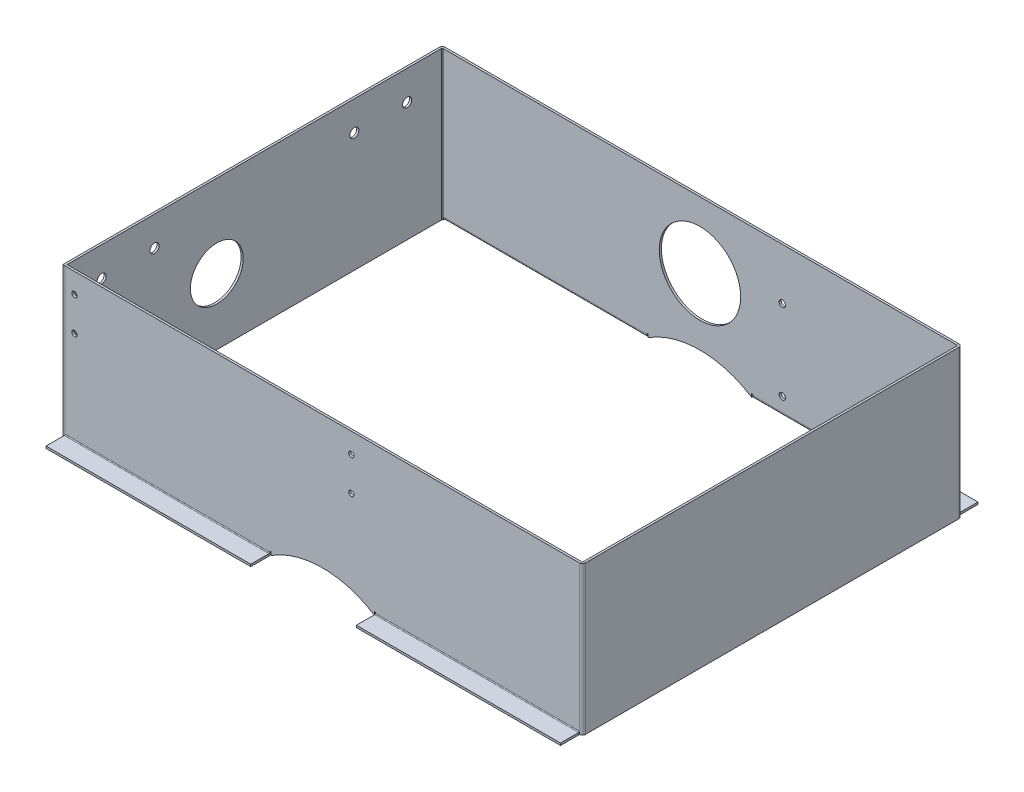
ISO-10303-21;
HEADER;
FILE_DESCRIPTION(('STEP AP214'),'2;1');
FILE_NAME('part.step','',(''),(''),'','','');
FILE_SCHEMA(('AUTOMOTIVE_DESIGN { 1 0 10303 214 1 1 1 1 }'));
ENDSEC;
DATA;
#1=APPLICATION_CONTEXT('core data for automotive mechanical design processes');
#2=APPLICATION_PROTOCOL_DEFINITION('international standard','automotive_design',2000,#1);
#3=PRODUCT_CONTEXT('',#1,'mechanical');
#4=PRODUCT('Part','Part','',(#3));
#5=PRODUCT_RELATED_PRODUCT_CATEGORY('part','',(#4));
#6=PRODUCT_DEFINITION_FORMATION('','',#4);
#7=PRODUCT_DEFINITION_CONTEXT('part definition',#1,'design');
#8=PRODUCT_DEFINITION('design','',#6,#7);
#9=PRODUCT_DEFINITION_SHAPE('','',#8);
#10=(LENGTH_UNIT() NAMED_UNIT(*) SI_UNIT(.MILLI.,.METRE.));
#11=(NAMED_UNIT(*) PLANE_ANGLE_UNIT() SI_UNIT($,.RADIAN.));
#12=(NAMED_UNIT(*) SI_UNIT($,.STERADIAN.) SOLID_ANGLE_UNIT());
#13=UNCERTAINTY_MEASURE_WITH_UNIT(LENGTH_MEASURE(1.E-05),#10,'distance_accuracy_value','');
#14=(GEOMETRIC_REPRESENTATION_CONTEXT(3) GLOBAL_UNCERTAINTY_ASSIGNED_CONTEXT((#13)) GLOBAL_UNIT_ASSIGNED_CONTEXT((#10,
#11,#12)) REPRESENTATION_CONTEXT('',''));
#15=CARTESIAN_POINT('',(0.,0.,0.));
#16=DIRECTION('',(0.,0.,1.));
#17=DIRECTION('',(1.,0.,0.));
#18=AXIS2_PLACEMENT_3D('',#15,#16,#17);
#19=CARTESIAN_POINT('',(243.063400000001,-77.7999999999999,359.));
#20=DIRECTION('',(-1.,0.,0.));
#21=DIRECTION('',(0.,0.,1.));
#22=AXIS2_PLACEMENT_3D('',#19,#20,#21);
#23=PLANE('',#22);
#24=DIRECTION('',(0.,1.,2.43416580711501E-13));
#25=VECTOR('',#24,1.);
#26=CARTESIAN_POINT('',(243.063400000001,-77.7999999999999,359.));
#27=LINE('',#26,#25);
#28=CARTESIAN_POINT('',(243.063400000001,-77.7999999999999,359.));
#29=VERTEX_POINT('',#28);
#30=CARTESIAN_POINT('',(243.063400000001,-77.6990023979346,359.));
#31=VERTEX_POINT('',#30);
#32=EDGE_CURVE('E745',#29,#31,#27,.T.);
#33=ORIENTED_EDGE('',*,*,#32,.T.);
#34=CARTESIAN_POINT('',(243.063400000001,-75.0633999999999,359.736600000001));
#35=DIRECTION('',(1.,0.,0.));
#36=DIRECTION('',(0.,0.,-1.));
#37=AXIS2_PLACEMENT_3D('',#34,#35,#36);
#38=CIRCLE('',#37,2.7366);
#39=CARTESIAN_POINT('',(243.063400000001,-75.0633999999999,357.));
#40=VERTEX_POINT('',#39);
#41=EDGE_CURVE('E13',#31,#40,#38,.T.);
#42=ORIENTED_EDGE('',*,*,#41,.T.);
#43=DIRECTION('',(0.,1.,0.));
#44=VECTOR('',#43,1.);
#45=CARTESIAN_POINT('',(243.063400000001,-77.7999999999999,357.));
#46=LINE('',#45,#44);
#47=CARTESIAN_POINT('',(243.063400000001,-77.7999999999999,357.));
#48=VERTEX_POINT('',#47);
#49=EDGE_CURVE('E870',#48,#40,#46,.T.);
#50=ORIENTED_EDGE('',*,*,#49,.F.);
#51=DIRECTION('',(0.,0.,-1.));
#52=VECTOR('',#51,1.);
#53=CARTESIAN_POINT('',(243.063400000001,-77.7999999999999,359.));
#54=LINE('',#53,#52);
#55=EDGE_CURVE('E850',#48,#29,#54,.F.);
#56=ORIENTED_EDGE('',*,*,#55,.T.);
#57=EDGE_LOOP('',(#33,#42,#50,#56));
#58=FACE_BOUND('',#57,.T.);
#59=ADVANCED_FACE('F172',(#58),#23,.T.);
#60=CARTESIAN_POINT('',(-243.0634,-77.8,0.));
#61=DIRECTION('',(1.,0.,0.));
#62=DIRECTION('',(0.,0.,-1.));
#63=AXIS2_PLACEMENT_3D('',#60,#61,#62);
#64=PLANE('',#63);
#65=DIRECTION('',(0.,-1.,0.));
#66=VECTOR('',#65,1.);
#67=CARTESIAN_POINT('',(-243.0634,-77.8,0.));
#68=LINE('',#67,#66);
#69=CARTESIAN_POINT('',(-243.0634,-77.8,0.));
#70=VERTEX_POINT('',#69);
#71=CARTESIAN_POINT('',(-243.0634,-77.6990023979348,0.));
#72=VERTEX_POINT('',#71);
#73=EDGE_CURVE('E968',#70,#72,#68,.F.);
#74=ORIENTED_EDGE('',*,*,#73,.T.);
#75=CARTESIAN_POINT('',(-243.0634,-75.0634,-0.736600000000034));
#76=DIRECTION('',(-1.,0.,0.));
#77=DIRECTION('',(0.,0.,1.));
#78=AXIS2_PLACEMENT_3D('',#75,#76,#77);
#79=CIRCLE('',#78,2.73659999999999);
#80=CARTESIAN_POINT('',(-243.0634,-75.0634,1.99999999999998));
#81=VERTEX_POINT('',#80);
#82=EDGE_CURVE('E181',#72,#81,#79,.T.);
#83=ORIENTED_EDGE('',*,*,#82,.T.);
#84=DIRECTION('',(0.,-1.,0.));
#85=VECTOR('',#84,1.);
#86=CARTESIAN_POINT('',(-243.0634,-77.8,1.99999999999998));
#87=LINE('',#86,#85);
#88=CARTESIAN_POINT('',(-243.0634,-77.8,1.99999999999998));
#89=VERTEX_POINT('',#88);
#90=EDGE_CURVE('E962',#89,#81,#87,.F.);
#91=ORIENTED_EDGE('',*,*,#90,.F.);
#92=DIRECTION('',(0.,0.,-1.));
#93=VECTOR('',#92,1.);
#94=CARTESIAN_POINT('',(-243.0634,-77.8,1.99999999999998));
#95=LINE('',#94,#93);
#96=EDGE_CURVE('E974',#89,#70,#95,.T.);
#97=ORIENTED_EDGE('',*,*,#96,.T.);
#98=EDGE_LOOP('',(#74,#83,#91,#97));
#99=FACE_BOUND('',#98,.T.);
#100=ADVANCED_FACE('F1073',(#99),#64,.T.);
#101=CARTESIAN_POINT('',(243.0634,-75.0633999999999,0.));
#102=DIRECTION('',(-1.,0.,0.));
#103=DIRECTION('',(0.,-1.,0.));
#104=AXIS2_PLACEMENT_3D('',#101,#102,#103);
#105=PLANE('',#104);
#106=DIRECTION('',(0.,1.,0.));
#107=VECTOR('',#106,1.);
#108=CARTESIAN_POINT('',(243.0634,62.8000000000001,2.));
#109=LINE('',#108,#107);
#110=CARTESIAN_POINT('',(243.0634,-75.0633999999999,2.));
#111=VERTEX_POINT('',#110);
#112=CARTESIAN_POINT('',(243.0634,-77.7999999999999,2.));
#113=VERTEX_POINT('',#112);
#114=EDGE_CURVE('E1009',#111,#113,#109,.F.);
#115=ORIENTED_EDGE('',*,*,#114,.F.);
#116=CARTESIAN_POINT('',(243.0634,-75.0633999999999,-0.736600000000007));
#117=DIRECTION('',(-1.,0.,0.));
#118=DIRECTION('',(0.,0.,1.));
#119=AXIS2_PLACEMENT_3D('',#116,#117,#118);
#120=CIRCLE('',#119,2.73659999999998);
#121=CARTESIAN_POINT('',(243.0634,-77.6990023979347,0.));
#122=VERTEX_POINT('',#121);
#123=EDGE_CURVE('E718',#111,#122,#120,.F.);
#124=ORIENTED_EDGE('',*,*,#123,.T.);
#125=DIRECTION('',(0.,-1.,0.));
#126=VECTOR('',#125,1.);
#127=CARTESIAN_POINT('',(243.0634,-75.0633999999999,0.));
#128=LINE('',#127,#126);
#129=CARTESIAN_POINT('',(243.0634,-77.7999999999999,0.));
#130=VERTEX_POINT('',#129);
#131=EDGE_CURVE('E792',#122,#130,#128,.T.);
#132=ORIENTED_EDGE('',*,*,#131,.T.);
#133=DIRECTION('',(0.,0.,-1.));
#134=VECTOR('',#133,1.);
#135=CARTESIAN_POINT('',(243.0634,-77.7999999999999,2.));
#136=LINE('',#135,#134);
#137=EDGE_CURVE('E1021',#113,#130,#136,.T.);
#138=ORIENTED_EDGE('',*,*,#137,.F.);
#139=EDGE_LOOP('',(#115,#124,#132,#138));
#140=FACE_BOUND('',#139,.T.);
#141=ADVANCED_FACE('F1165',(#140),#105,.T.);
#142=CARTESIAN_POINT('',(243.800000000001,62.8000000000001,359.));
#143=DIRECTION('',(0.,0.,-1.));
#144=DIRECTION('',(-1.,0.,0.));
#145=AXIS2_PLACEMENT_3D('',#142,#143,#144);
#146=PLANE('',#145);
#147=CARTESIAN_POINT('',(-234.800000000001,43.8000000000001,359.000000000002));
#148=DIRECTION('',(0.,0.,1.));
#149=DIRECTION('',(1.,0.,0.));
#150=AXIS2_PLACEMENT_3D('',#147,#148,#149);
#151=CIRCLE('',#150,2.5);
#152=CARTESIAN_POINT('',(-232.300000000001,43.8000000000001,359.000000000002));
#153=VERTEX_POINT('',#152);
#154=EDGE_CURVE('E844',#153,#153,#151,.T.);
#155=ORIENTED_EDGE('',*,*,#154,.F.);
#156=EDGE_LOOP('',(#155));
#157=FACE_BOUND('',#156,.T.);
#158=CARTESIAN_POINT('',(-234.800000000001,11.8000000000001,359.000000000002));
#159=DIRECTION('',(0.,0.,1.));
#160=DIRECTION('',(1.,0.,0.));
#161=AXIS2_PLACEMENT_3D('',#158,#159,#160);
#162=CIRCLE('',#161,2.5);
#163=CARTESIAN_POINT('',(-232.300000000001,11.8000000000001,359.000000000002));
#164=VERTEX_POINT('',#163);
#165=EDGE_CURVE('E838',#164,#164,#162,.T.);
#166=ORIENTED_EDGE('',*,*,#165,.F.);
#167=EDGE_LOOP('',(#166));
#168=FACE_BOUND('',#167,.T.);
#169=CARTESIAN_POINT('',(27.1999999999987,43.8000000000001,359.000000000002));
#170=DIRECTION('',(0.,0.,1.));
#171=DIRECTION('',(1.,0.,0.));
#172=AXIS2_PLACEMENT_3D('',#169,#170,#171);
#173=CIRCLE('',#172,2.5);
#174=CARTESIAN_POINT('',(29.6999999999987,43.8000000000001,359.000000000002));
#175=VERTEX_POINT('',#174);
#176=EDGE_CURVE('E832',#175,#175,#173,.T.);
#177=ORIENTED_EDGE('',*,*,#176,.F.);
#178=EDGE_LOOP('',(#177));
#179=FACE_BOUND('',#178,.T.);
#180=CARTESIAN_POINT('',(27.1999999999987,11.8000000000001,359.000000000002));
#181=DIRECTION('',(0.,0.,1.));
#182=DIRECTION('',(1.,0.,0.));
#183=AXIS2_PLACEMENT_3D('',#180,#181,#182);
#184=CIRCLE('',#183,2.5);
#185=CARTESIAN_POINT('',(29.6999999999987,11.8000000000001,359.000000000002));
#186=VERTEX_POINT('',#185);
#187=EDGE_CURVE('E826',#186,#186,#184,.T.);
#188=ORIENTED_EDGE('',*,*,#187,.F.);
#189=EDGE_LOOP('',(#188));
#190=FACE_BOUND('',#189,.T.);
#191=DIRECTION('',(0.,1.,2.33807983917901E-13));
#192=VECTOR('',#191,1.);
#193=CARTESIAN_POINT('',(-48.9899989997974,-77.1498855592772,359.000000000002));
#194=LINE('',#193,#192);
#195=CARTESIAN_POINT('',(-48.9899989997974,-77.1498855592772,359.000000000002));
#196=VERTEX_POINT('',#195);
#197=CARTESIAN_POINT('',(-48.9899989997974,-74.0633999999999,359.000000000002));
#198=VERTEX_POINT('',#197);
#199=EDGE_CURVE('E726',#196,#198,#194,.T.);
#200=ORIENTED_EDGE('',*,*,#199,.F.);
#201=CARTESIAN_POINT('',(2.4833226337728E-12,-153.6,359.000000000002));
#202=DIRECTION('',(0.,0.,-1.));
#203=DIRECTION('',(-1.,0.,0.));
#204=AXIS2_PLACEMENT_3D('',#201,#202,#203);
#205=CIRCLE('',#204,90.8);
#206=CARTESIAN_POINT('',(48.9899989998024,-77.1498855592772,359.000000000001));
#207=VERTEX_POINT('',#206);
#208=EDGE_CURVE('E824',#196,#207,#205,.T.);
#209=ORIENTED_EDGE('',*,*,#208,.T.);
#210=DIRECTION('',(0.,-1.,2.33807983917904E-13));
#211=VECTOR('',#210,1.);
#212=CARTESIAN_POINT('',(48.9899989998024,-74.0633999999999,359.000000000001));
#213=LINE('',#212,#211);
#214=CARTESIAN_POINT('',(48.9899989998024,-74.0633999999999,359.000000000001));
#215=VERTEX_POINT('',#214);
#216=EDGE_CURVE('E755',#215,#207,#213,.T.);
#217=ORIENTED_EDGE('',*,*,#216,.F.);
#218=DIRECTION('',(-1.,0.,0.));
#219=VECTOR('',#218,1.);
#220=CARTESIAN_POINT('',(49.9899989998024,-74.0633999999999,359.000000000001));
#221=LINE('',#220,#219);
#222=CARTESIAN_POINT('',(49.9899989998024,-74.0633999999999,359.000000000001));
#223=VERTEX_POINT('',#222);
#224=EDGE_CURVE('E751',#223,#215,#221,.T.);
#225=ORIENTED_EDGE('',*,*,#224,.F.);
#226=DIRECTION('',(0.,1.,0.));
#227=VECTOR('',#226,1.);
#228=CARTESIAN_POINT('',(49.9899989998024,-75.0633999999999,359.000000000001));
#229=LINE('',#228,#227);
#230=CARTESIAN_POINT('',(49.9899989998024,-75.0633999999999,359.000000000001));
#231=VERTEX_POINT('',#230);
#232=EDGE_CURVE('E748',#231,#223,#229,.T.);
#233=ORIENTED_EDGE('',*,*,#232,.F.);
#234=DIRECTION('',(1.,0.,0.));
#235=VECTOR('',#234,1.);
#236=CARTESIAN_POINT('',(243.063400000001,-75.0633999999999,359.000000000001));
#237=LINE('',#236,#235);
#238=CARTESIAN_POINT('',(243.063400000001,-75.0633999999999,359.000000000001));
#239=VERTEX_POINT('',#238);
#240=EDGE_CURVE('E606',#239,#231,#237,.F.);
#241=ORIENTED_EDGE('',*,*,#240,.F.);
#242=DIRECTION('',(0.,1.,0.));
#243=VECTOR('',#242,1.);
#244=CARTESIAN_POINT('',(243.063400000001,-77.7999999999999,359.));
#245=LINE('',#244,#243);
#246=CARTESIAN_POINT('',(243.063400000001,62.8000000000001,359.));
#247=VERTEX_POINT('',#246);
#248=EDGE_CURVE('E865',#247,#239,#245,.F.);
#249=ORIENTED_EDGE('',*,*,#248,.F.);
#250=DIRECTION('',(-1.,0.,0.));
#251=VECTOR('',#250,1.);
#252=CARTESIAN_POINT('',(243.800000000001,62.8000000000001,359.));
#253=LINE('',#252,#251);
#254=CARTESIAN_POINT('',(-243.699999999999,62.8000000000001,359.000000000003));
#255=VERTEX_POINT('',#254);
#256=EDGE_CURVE('E858',#247,#255,#253,.T.);
#257=ORIENTED_EDGE('',*,*,#256,.T.);
#258=DIRECTION('',(0.,-1.,0.));
#259=VECTOR('',#258,1.);
#260=CARTESIAN_POINT('',(-243.699999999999,62.8000000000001,359.000000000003));
#261=LINE('',#260,#259);
#262=CARTESIAN_POINT('',(-243.699999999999,-75.0633999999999,359.000000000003));
#263=VERTEX_POINT('',#262);
#264=EDGE_CURVE('E855',#255,#263,#261,.T.);
#265=ORIENTED_EDGE('',*,*,#264,.T.);
#266=DIRECTION('',(1.,0.,0.));
#267=VECTOR('',#266,1.);
#268=CARTESIAN_POINT('',(-49.9899989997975,-75.0633999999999,359.000000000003));
#269=LINE('',#268,#267);
#270=CARTESIAN_POINT('',(-49.9899989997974,-75.0633999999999,359.000000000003));
#271=VERTEX_POINT('',#270);
#272=EDGE_CURVE('E553',#271,#263,#269,.F.);
#273=ORIENTED_EDGE('',*,*,#272,.F.);
#274=DIRECTION('',(0.,-1.,0.));
#275=VECTOR('',#274,1.);
#276=CARTESIAN_POINT('',(-49.9899989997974,-74.0633999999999,359.000000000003));
#277=LINE('',#276,#275);
#278=CARTESIAN_POINT('',(-49.9899989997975,-74.0633999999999,359.000000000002));
#279=VERTEX_POINT('',#278);
#280=EDGE_CURVE('E735',#279,#271,#277,.T.);
#281=ORIENTED_EDGE('',*,*,#280,.F.);
#282=DIRECTION('',(-1.,0.,0.));
#283=VECTOR('',#282,1.);
#284=CARTESIAN_POINT('',(-48.9899989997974,-74.0633999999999,359.000000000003));
#285=LINE('',#284,#283);
#286=EDGE_CURVE('E731',#198,#279,#285,.T.);
#287=ORIENTED_EDGE('',*,*,#286,.F.);
#288=EDGE_LOOP('',(#200,#209,#217,#225,#233,#241,#249,#257,#265,#273,#281,#287));
#289=FACE_BOUND('',#288,.T.);
#290=ADVANCED_FACE('F1188',(#157,#168,#179,#190,#289),#146,.F.);
#291=CARTESIAN_POINT('',(243.800000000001,62.8000000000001,357.));
#292=DIRECTION('',(0.,0.,-1.));
#293=DIRECTION('',(-1.,0.,0.));
#294=AXIS2_PLACEMENT_3D('',#291,#292,#293);
#295=PLANE('',#294);
#296=CARTESIAN_POINT('',(-234.800000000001,43.8000000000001,357.000000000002));
#297=DIRECTION('',(0.,0.,1.));
#298=DIRECTION('',(1.,0.,0.));
#299=AXIS2_PLACEMENT_3D('',#296,#297,#298);
#300=CIRCLE('',#299,2.5);
#301=CARTESIAN_POINT('',(-232.300000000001,43.8000000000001,357.000000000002));
#302=VERTEX_POINT('',#301);
#303=EDGE_CURVE('E847',#302,#302,#300,.T.);
#304=ORIENTED_EDGE('',*,*,#303,.T.);
#305=EDGE_LOOP('',(#304));
#306=FACE_BOUND('',#305,.T.);
#307=CARTESIAN_POINT('',(-234.800000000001,11.8000000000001,357.000000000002));
#308=DIRECTION('',(0.,0.,1.));
#309=DIRECTION('',(1.,0.,0.));
#310=AXIS2_PLACEMENT_3D('',#307,#308,#309);
#311=CIRCLE('',#310,2.5);
#312=CARTESIAN_POINT('',(-232.300000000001,11.8000000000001,357.000000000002));
#313=VERTEX_POINT('',#312);
#314=EDGE_CURVE('E841',#313,#313,#311,.T.);
#315=ORIENTED_EDGE('',*,*,#314,.T.);
#316=EDGE_LOOP('',(#315));
#317=FACE_BOUND('',#316,.T.);
#318=CARTESIAN_POINT('',(27.1999999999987,43.8000000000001,357.000000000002));
#319=DIRECTION('',(0.,0.,1.));
#320=DIRECTION('',(1.,0.,0.));
#321=AXIS2_PLACEMENT_3D('',#318,#319,#320);
#322=CIRCLE('',#321,2.5);
#323=CARTESIAN_POINT('',(29.6999999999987,43.8000000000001,357.000000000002));
#324=VERTEX_POINT('',#323);
#325=EDGE_CURVE('E835',#324,#324,#322,.T.);
#326=ORIENTED_EDGE('',*,*,#325,.T.);
#327=EDGE_LOOP('',(#326));
#328=FACE_BOUND('',#327,.T.);
#329=CARTESIAN_POINT('',(27.1999999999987,11.8000000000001,357.000000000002));
#330=DIRECTION('',(0.,0.,1.));
#331=DIRECTION('',(1.,0.,0.));
#332=AXIS2_PLACEMENT_3D('',#329,#330,#331);
#333=CIRCLE('',#332,2.5);
#334=CARTESIAN_POINT('',(29.6999999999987,11.8000000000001,357.000000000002));
#335=VERTEX_POINT('',#334);
#336=EDGE_CURVE('E829',#335,#335,#333,.T.);
#337=ORIENTED_EDGE('',*,*,#336,.T.);
#338=EDGE_LOOP('',(#337));
#339=FACE_BOUND('',#338,.T.);
#340=CARTESIAN_POINT('',(2.46943061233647E-12,-153.6,357.000000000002));
#341=DIRECTION('',(0.,0.,-1.));
#342=DIRECTION('',(1.,0.,0.));
#343=AXIS2_PLACEMENT_3D('',#340,#341,#342);
#344=CIRCLE('',#343,90.8);
#345=CARTESIAN_POINT('',(-48.9899989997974,-77.1498855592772,357.000000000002));
#346=VERTEX_POINT('',#345);
#347=CARTESIAN_POINT('',(48.9899989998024,-77.1498855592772,357.000000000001));
#348=VERTEX_POINT('',#347);
#349=EDGE_CURVE('E822',#346,#348,#344,.T.);
#350=ORIENTED_EDGE('',*,*,#349,.F.);
#351=DIRECTION('',(0.,1.,0.));
#352=VECTOR('',#351,1.);
#353=CARTESIAN_POINT('',(-48.9899989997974,62.8000000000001,357.000000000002));
#354=LINE('',#353,#352);
#355=CARTESIAN_POINT('',(-48.9899989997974,-74.0633999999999,357.000000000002));
#356=VERTEX_POINT('',#355);
#357=EDGE_CURVE('E729',#346,#356,#354,.T.);
#358=ORIENTED_EDGE('',*,*,#357,.T.);
#359=DIRECTION('',(-1.,0.,0.));
#360=VECTOR('',#359,1.);
#361=CARTESIAN_POINT('',(243.800000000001,-74.0633999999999,357.));
#362=LINE('',#361,#360);
#363=CARTESIAN_POINT('',(-49.9899989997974,-74.0633999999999,357.000000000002));
#364=VERTEX_POINT('',#363);
#365=EDGE_CURVE('E176',#356,#364,#362,.T.);
#366=ORIENTED_EDGE('',*,*,#365,.T.);
#367=DIRECTION('',(0.,-1.,0.));
#368=VECTOR('',#367,1.);
#369=CARTESIAN_POINT('',(-49.9899989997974,62.8000000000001,357.000000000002));
#370=LINE('',#369,#368);
#371=CARTESIAN_POINT('',(-49.9899989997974,-75.0633999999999,357.000000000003));
#372=VERTEX_POINT('',#371);
#373=EDGE_CURVE('E1065',#364,#372,#370,.T.);
#374=ORIENTED_EDGE('',*,*,#373,.T.);
#375=DIRECTION('',(1.,0.,0.));
#376=VECTOR('',#375,1.);
#377=CARTESIAN_POINT('',(-49.9899989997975,-75.0633999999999,357.000000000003));
#378=LINE('',#377,#376);
#379=CARTESIAN_POINT('',(-243.699999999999,-75.0633999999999,357.000000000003));
#380=VERTEX_POINT('',#379);
#381=EDGE_CURVE('E558',#372,#380,#378,.F.);
#382=ORIENTED_EDGE('',*,*,#381,.T.);
#383=DIRECTION('',(0.,1.,0.));
#384=VECTOR('',#383,1.);
#385=CARTESIAN_POINT('',(-243.699999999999,-77.7999999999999,357.000000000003));
#386=LINE('',#385,#384);
#387=CARTESIAN_POINT('',(-243.699999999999,62.8000000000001,357.000000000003));
#388=VERTEX_POINT('',#387);
#389=EDGE_CURVE('E860',#388,#380,#386,.F.);
#390=ORIENTED_EDGE('',*,*,#389,.F.);
#391=DIRECTION('',(1.,0.,0.));
#392=VECTOR('',#391,1.);
#393=CARTESIAN_POINT('',(-243.699999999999,62.8000000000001,357.000000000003));
#394=LINE('',#393,#392);
#395=CARTESIAN_POINT('',(243.063400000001,62.8000000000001,357.));
#396=VERTEX_POINT('',#395);
#397=EDGE_CURVE('E863',#396,#388,#394,.F.);
#398=ORIENTED_EDGE('',*,*,#397,.F.);
#399=EDGE_CURVE('E873',#40,#396,#46,.T.);
#400=ORIENTED_EDGE('',*,*,#399,.F.);
#401=DIRECTION('',(1.,0.,0.));
#402=VECTOR('',#401,1.);
#403=CARTESIAN_POINT('',(243.063400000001,-75.0633999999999,357.000000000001));
#404=LINE('',#403,#402);
#405=CARTESIAN_POINT('',(49.9899989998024,-75.0633999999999,357.000000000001));
#406=VERTEX_POINT('',#405);
#407=EDGE_CURVE('E611',#40,#406,#404,.F.);
#408=ORIENTED_EDGE('',*,*,#407,.T.);
#409=DIRECTION('',(0.,1.,0.));
#410=VECTOR('',#409,1.);
#411=CARTESIAN_POINT('',(49.9899989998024,62.8000000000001,357.000000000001));
#412=LINE('',#411,#410);
#413=CARTESIAN_POINT('',(49.9899989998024,-74.0633999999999,357.000000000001));
#414=VERTEX_POINT('',#413);
#415=EDGE_CURVE('E1063',#406,#414,#412,.T.);
#416=ORIENTED_EDGE('',*,*,#415,.T.);
#417=DIRECTION('',(-1.,0.,0.));
#418=VECTOR('',#417,1.);
#419=CARTESIAN_POINT('',(243.800000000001,-74.0633999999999,357.));
#420=LINE('',#419,#418);
#421=CARTESIAN_POINT('',(48.9899989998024,-74.0633999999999,357.000000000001));
#422=VERTEX_POINT('',#421);
#423=EDGE_CURVE('E1060',#414,#422,#420,.T.);
#424=ORIENTED_EDGE('',*,*,#423,.T.);
#425=DIRECTION('',(0.,-1.,0.));
#426=VECTOR('',#425,1.);
#427=CARTESIAN_POINT('',(48.9899989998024,62.8000000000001,357.000000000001));
#428=LINE('',#427,#426);
#429=EDGE_CURVE('E747',#422,#348,#428,.T.);
#430=ORIENTED_EDGE('',*,*,#429,.T.);
#431=EDGE_LOOP('',(#350,#358,#366,#374,#382,#390,#398,#400,#408,#416,#424,#430));
#432=FACE_BOUND('',#431,.T.);
#433=ADVANCED_FACE('F1205',(#306,#317,#328,#339,#432),#295,.T.);
#434=CARTESIAN_POINT('',(2.46943061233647E-12,-153.6,357.000000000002));
#435=DIRECTION('',(0.,0.,-1.));
#436=DIRECTION('',(-1.,0.,0.));
#437=AXIS2_PLACEMENT_3D('',#434,#435,#436);
#438=CYLINDRICAL_SURFACE('',#437,90.8);
#439=ORIENTED_EDGE('',*,*,#208,.F.);
#440=DIRECTION('',(0.,0.,-1.));
#441=VECTOR('',#440,1.);
#442=CARTESIAN_POINT('',(-48.9899989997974,-77.1498855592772,359.000000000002));
#443=LINE('',#442,#441);
#444=EDGE_CURVE('E730',#196,#346,#443,.T.);
#445=ORIENTED_EDGE('',*,*,#444,.T.);
#446=ORIENTED_EDGE('',*,*,#349,.T.);
#447=DIRECTION('',(0.,0.,-1.));
#448=VECTOR('',#447,1.);
#449=CARTESIAN_POINT('',(48.9899989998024,-77.1498855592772,359.000000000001));
#450=LINE('',#449,#448);
#451=EDGE_CURVE('E758',#207,#348,#450,.T.);
#452=ORIENTED_EDGE('',*,*,#451,.F.);
#453=EDGE_LOOP('',(#439,#445,#446,#452));
#454=FACE_BOUND('',#453,.T.);
#455=ADVANCED_FACE('F1201',(#454),#438,.F.);
#456=CARTESIAN_POINT('',(-243.699999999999,-77.7999999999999,359.000000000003));
#457=DIRECTION('',(1.,0.,0.));
#458=DIRECTION('',(0.,0.,-1.));
#459=AXIS2_PLACEMENT_3D('',#456,#457,#458);
#460=PLANE('',#459);
#461=DIRECTION('',(0.,0.,-1.));
#462=VECTOR('',#461,1.);
#463=CARTESIAN_POINT('',(-243.699999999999,-75.0633999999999,359.000000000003));
#464=LINE('',#463,#462);
#465=EDGE_CURVE('E567',#263,#380,#464,.T.);
#466=ORIENTED_EDGE('',*,*,#465,.F.);
#467=ORIENTED_EDGE('',*,*,#264,.F.);
#468=DIRECTION('',(0.,0.,-1.));
#469=VECTOR('',#468,1.);
#470=CARTESIAN_POINT('',(-243.699999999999,62.8000000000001,359.000000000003));
#471=LINE('',#470,#469);
#472=EDGE_CURVE('E851',#255,#388,#471,.T.);
#473=ORIENTED_EDGE('',*,*,#472,.T.);
#474=ORIENTED_EDGE('',*,*,#389,.T.);
#475=EDGE_LOOP('',(#466,#467,#473,#474));
#476=FACE_BOUND('',#475,.T.);
#477=ADVANCED_FACE('F1204',(#476),#460,.F.);
#478=CARTESIAN_POINT('',(0.,-153.6,2.));
#479=DIRECTION('',(0.,0.,1.));
#480=DIRECTION('',(1.,0.,0.));
#481=AXIS2_PLACEMENT_3D('',#478,#479,#480);
#482=PLANE('',#481);
#483=CARTESIAN_POINT('',(77.9,-61.8,2.));
#484=DIRECTION('',(0.,0.,1.));
#485=DIRECTION('',(1.,0.,0.));
#486=AXIS2_PLACEMENT_3D('',#483,#484,#485);
#487=CIRCLE('',#486,3.00000000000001);
#488=CARTESIAN_POINT('',(80.9,-61.8,2.));
#489=VERTEX_POINT('',#488);
#490=EDGE_CURVE('E1035',#489,#489,#487,.T.);
#491=ORIENTED_EDGE('',*,*,#490,.F.);
#492=EDGE_LOOP('',(#491));
#493=FACE_BOUND('',#492,.T.);
#494=CARTESIAN_POINT('',(0.,0.,2.));
#495=DIRECTION('',(0.,0.,1.));
#496=DIRECTION('',(1.,0.,0.));
#497=AXIS2_PLACEMENT_3D('',#494,#495,#496);
#498=CIRCLE('',#497,38.5);
#499=CARTESIAN_POINT('',(38.5,0.,2.));
#500=VERTEX_POINT('',#499);
#501=EDGE_CURVE('E1047',#500,#500,#498,.T.);
#502=ORIENTED_EDGE('',*,*,#501,.F.);
#503=EDGE_LOOP('',(#502));
#504=FACE_BOUND('',#503,.T.);
#505=CARTESIAN_POINT('',(77.9,14.2,2.));
#506=DIRECTION('',(0.,0.,1.));
#507=DIRECTION('',(1.,0.,0.));
#508=AXIS2_PLACEMENT_3D('',#505,#506,#507);
#509=CIRCLE('',#508,3.00000000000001);
#510=CARTESIAN_POINT('',(80.9,14.2,2.));
#511=VERTEX_POINT('',#510);
#512=EDGE_CURVE('E1041',#511,#511,#509,.T.);
#513=ORIENTED_EDGE('',*,*,#512,.F.);
#514=EDGE_LOOP('',(#513));
#515=FACE_BOUND('',#514,.T.);
#516=CARTESIAN_POINT('',(139.9,-61.8,2.));
#517=DIRECTION('',(0.,0.,1.));
#518=DIRECTION('',(1.,0.,0.));
#519=AXIS2_PLACEMENT_3D('',#516,#517,#518);
#520=CIRCLE('',#519,2.99999999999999);
#521=CARTESIAN_POINT('',(142.9,-61.8,2.));
#522=VERTEX_POINT('',#521);
#523=EDGE_CURVE('E1029',#522,#522,#520,.T.);
#524=ORIENTED_EDGE('',*,*,#523,.F.);
#525=EDGE_LOOP('',(#524));
#526=FACE_BOUND('',#525,.T.);
#527=CARTESIAN_POINT('',(-243.0634,62.8,2.));
#528=VERTEX_POINT('',#527);
#529=EDGE_CURVE('E965',#81,#528,#87,.F.);
#530=ORIENTED_EDGE('',*,*,#529,.F.);
#531=DIRECTION('',(-1.,0.,0.));
#532=VECTOR('',#531,1.);
#533=CARTESIAN_POINT('',(-243.0634,-75.0634,1.99999999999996));
#534=LINE('',#533,#532);
#535=CARTESIAN_POINT('',(-49.9899989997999,-75.0634,2.));
#536=VERTEX_POINT('',#535);
#537=EDGE_CURVE('E662',#81,#536,#534,.F.);
#538=ORIENTED_EDGE('',*,*,#537,.T.);
#539=DIRECTION('',(0.,1.,0.));
#540=VECTOR('',#539,1.);
#541=CARTESIAN_POINT('',(-49.9899989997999,-153.6,2.));
#542=LINE('',#541,#540);
#543=CARTESIAN_POINT('',(-49.9899989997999,-74.0634,2.));
#544=VERTEX_POINT('',#543);
#545=EDGE_CURVE('E789',#536,#544,#542,.T.);
#546=ORIENTED_EDGE('',*,*,#545,.T.);
#547=DIRECTION('',(1.,0.,0.));
#548=VECTOR('',#547,1.);
#549=CARTESIAN_POINT('',(0.,-74.0634,2.));
#550=LINE('',#549,#548);
#551=CARTESIAN_POINT('',(-48.9899989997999,-74.0634,2.));
#552=VERTEX_POINT('',#551);
#553=EDGE_CURVE('E786',#544,#552,#550,.T.);
#554=ORIENTED_EDGE('',*,*,#553,.T.);
#555=DIRECTION('',(0.,-1.,0.));
#556=VECTOR('',#555,1.);
#557=CARTESIAN_POINT('',(-48.9899989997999,-153.6,2.));
#558=LINE('',#557,#556);
#559=CARTESIAN_POINT('',(-48.9899989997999,-77.1498855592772,2.));
#560=VERTEX_POINT('',#559);
#561=EDGE_CURVE('E771',#552,#560,#558,.T.);
#562=ORIENTED_EDGE('',*,*,#561,.T.);
#563=CARTESIAN_POINT('',(0.,-153.6,2.));
#564=DIRECTION('',(0.,0.,-1.));
#565=DIRECTION('',(1.,0.,0.));
#566=AXIS2_PLACEMENT_3D('',#563,#564,#565);
#567=CIRCLE('',#566,90.8);
#568=CARTESIAN_POINT('',(48.9899989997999,-77.1498855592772,2.));
#569=VERTEX_POINT('',#568);
#570=EDGE_CURVE('E1055',#560,#569,#567,.T.);
#571=ORIENTED_EDGE('',*,*,#570,.T.);
#572=DIRECTION('',(0.,1.,0.));
#573=VECTOR('',#572,1.);
#574=CARTESIAN_POINT('',(48.9899989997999,-153.6,2.));
#575=LINE('',#574,#573);
#576=CARTESIAN_POINT('',(48.9899989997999,-74.0633999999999,2.));
#577=VERTEX_POINT('',#576);
#578=EDGE_CURVE('E796',#569,#577,#575,.T.);
#579=ORIENTED_EDGE('',*,*,#578,.T.);
#580=DIRECTION('',(1.,0.,0.));
#581=VECTOR('',#580,1.);
#582=CARTESIAN_POINT('',(0.,-74.0633999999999,2.));
#583=LINE('',#582,#581);
#584=CARTESIAN_POINT('',(49.9899989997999,-74.0633999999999,2.));
#585=VERTEX_POINT('',#584);
#586=EDGE_CURVE('E819',#577,#585,#583,.T.);
#587=ORIENTED_EDGE('',*,*,#586,.T.);
#588=DIRECTION('',(0.,-1.,0.));
#589=VECTOR('',#588,1.);
#590=CARTESIAN_POINT('',(49.9899989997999,-153.6,2.));
#591=LINE('',#590,#589);
#592=CARTESIAN_POINT('',(49.9899989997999,-75.0633999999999,2.));
#593=VERTEX_POINT('',#592);
#594=EDGE_CURVE('E816',#585,#593,#591,.T.);
#595=ORIENTED_EDGE('',*,*,#594,.T.);
#596=DIRECTION('',(-1.,0.,0.));
#597=VECTOR('',#596,1.);
#598=CARTESIAN_POINT('',(49.9899989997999,-75.0634,1.99999999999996));
#599=LINE('',#598,#597);
#600=EDGE_CURVE('E714',#593,#111,#599,.F.);
#601=ORIENTED_EDGE('',*,*,#600,.T.);
#602=CARTESIAN_POINT('',(243.0634,62.8000000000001,2.));
#603=VERTEX_POINT('',#602);
#604=EDGE_CURVE('E1006',#603,#111,#109,.F.);
#605=ORIENTED_EDGE('',*,*,#604,.F.);
#606=DIRECTION('',(-1.,0.,0.));
#607=VECTOR('',#606,1.);
#608=CARTESIAN_POINT('',(-245.8,62.8,2.));
#609=LINE('',#608,#607);
#610=EDGE_CURVE('E1057',#603,#528,#609,.T.);
#611=ORIENTED_EDGE('',*,*,#610,.T.);
#612=EDGE_LOOP('',(#530,#538,#546,#554,#562,#571,#579,#587,#595,#601,#605,#611));
#613=FACE_BOUND('',#612,.T.);
#614=ADVANCED_FACE('F1078',(#493,#504,#515,#526,#613),#482,.T.);
#615=CARTESIAN_POINT('',(0.,-153.6,0.));
#616=DIRECTION('',(0.,0.,1.));
#617=DIRECTION('',(1.,0.,0.));
#618=AXIS2_PLACEMENT_3D('',#615,#616,#617);
#619=PLANE('',#618);
#620=CARTESIAN_POINT('',(77.9,-61.8,0.));
#621=DIRECTION('',(0.,0.,1.));
#622=DIRECTION('',(1.,0.,0.));
#623=AXIS2_PLACEMENT_3D('',#620,#621,#622);
#624=CIRCLE('',#623,3.00000000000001);
#625=CARTESIAN_POINT('',(80.9,-61.8,0.));
#626=VERTEX_POINT('',#625);
#627=EDGE_CURVE('E1032',#626,#626,#624,.T.);
#628=ORIENTED_EDGE('',*,*,#627,.T.);
#629=EDGE_LOOP('',(#628));
#630=FACE_BOUND('',#629,.T.);
#631=CARTESIAN_POINT('',(0.,0.,0.));
#632=DIRECTION('',(0.,0.,1.));
#633=DIRECTION('',(1.,0.,0.));
#634=AXIS2_PLACEMENT_3D('',#631,#632,#633);
#635=CIRCLE('',#634,38.5);
#636=CARTESIAN_POINT('',(38.5,0.,0.));
#637=VERTEX_POINT('',#636);
#638=EDGE_CURVE('E1044',#637,#637,#635,.T.);
#639=ORIENTED_EDGE('',*,*,#638,.T.);
#640=EDGE_LOOP('',(#639));
#641=FACE_BOUND('',#640,.T.);
#642=CARTESIAN_POINT('',(77.9,14.2,0.));
#643=DIRECTION('',(0.,0.,1.));
#644=DIRECTION('',(1.,0.,0.));
#645=AXIS2_PLACEMENT_3D('',#642,#643,#644);
#646=CIRCLE('',#645,3.00000000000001);
#647=CARTESIAN_POINT('',(80.9,14.2,0.));
#648=VERTEX_POINT('',#647);
#649=EDGE_CURVE('E1038',#648,#648,#646,.T.);
#650=ORIENTED_EDGE('',*,*,#649,.T.);
#651=EDGE_LOOP('',(#650));
#652=FACE_BOUND('',#651,.T.);
#653=CARTESIAN_POINT('',(139.9,-61.8,0.));
#654=DIRECTION('',(0.,0.,1.));
#655=DIRECTION('',(1.,0.,0.));
#656=AXIS2_PLACEMENT_3D('',#653,#654,#655);
#657=CIRCLE('',#656,2.99999999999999);
#658=CARTESIAN_POINT('',(142.9,-61.8,0.));
#659=VERTEX_POINT('',#658);
#660=EDGE_CURVE('E1024',#659,#659,#657,.T.);
#661=ORIENTED_EDGE('',*,*,#660,.T.);
#662=EDGE_LOOP('',(#661));
#663=FACE_BOUND('',#662,.T.);
#664=DIRECTION('',(-1.,0.,0.));
#665=VECTOR('',#664,1.);
#666=CARTESIAN_POINT('',(-243.0634,-75.0634,0.));
#667=LINE('',#666,#665);
#668=CARTESIAN_POINT('',(-243.0634,-75.0634,0.));
#669=VERTEX_POINT('',#668);
#670=CARTESIAN_POINT('',(-49.9899989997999,-75.0634,0.));
#671=VERTEX_POINT('',#670);
#672=EDGE_CURVE('E657',#669,#671,#667,.F.);
#673=ORIENTED_EDGE('',*,*,#672,.F.);
#674=CARTESIAN_POINT('',(-243.0634,62.8,0.));
#675=VERTEX_POINT('',#674);
#676=EDGE_CURVE('E971',#669,#675,#68,.F.);
#677=ORIENTED_EDGE('',*,*,#676,.T.);
#678=DIRECTION('',(-1.,0.,0.));
#679=VECTOR('',#678,1.);
#680=CARTESIAN_POINT('',(-245.8,62.8,0.));
#681=LINE('',#680,#679);
#682=CARTESIAN_POINT('',(243.0634,62.8000000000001,0.));
#683=VERTEX_POINT('',#682);
#684=EDGE_CURVE('E1052',#683,#675,#681,.T.);
#685=ORIENTED_EDGE('',*,*,#684,.F.);
#686=DIRECTION('',(0.,1.,0.));
#687=VECTOR('',#686,1.);
#688=CARTESIAN_POINT('',(243.0634,62.8000000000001,0.));
#689=LINE('',#688,#687);
#690=CARTESIAN_POINT('',(243.0634,-75.0633999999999,0.));
#691=VERTEX_POINT('',#690);
#692=EDGE_CURVE('E1012',#683,#691,#689,.F.);
#693=ORIENTED_EDGE('',*,*,#692,.T.);
#694=DIRECTION('',(-1.,0.,0.));
#695=VECTOR('',#694,1.);
#696=CARTESIAN_POINT('',(49.9899989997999,-75.0633999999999,0.));
#697=LINE('',#696,#695);
#698=CARTESIAN_POINT('',(49.9899989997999,-75.0633999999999,0.));
#699=VERTEX_POINT('',#698);
#700=EDGE_CURVE('E709',#699,#691,#697,.F.);
#701=ORIENTED_EDGE('',*,*,#700,.F.);
#702=DIRECTION('',(0.,-1.,0.));
#703=VECTOR('',#702,1.);
#704=CARTESIAN_POINT('',(49.9899989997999,-74.0633999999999,0.));
#705=LINE('',#704,#703);
#706=CARTESIAN_POINT('',(49.9899989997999,-74.0633999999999,0.));
#707=VERTEX_POINT('',#706);
#708=EDGE_CURVE('E802',#707,#699,#705,.T.);
#709=ORIENTED_EDGE('',*,*,#708,.F.);
#710=DIRECTION('',(1.,0.,0.));
#711=VECTOR('',#710,1.);
#712=CARTESIAN_POINT('',(48.9899989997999,-74.0633999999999,0.));
#713=LINE('',#712,#711);
#714=CARTESIAN_POINT('',(48.9899989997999,-74.0633999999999,0.));
#715=VERTEX_POINT('',#714);
#716=EDGE_CURVE('E798',#715,#707,#713,.T.);
#717=ORIENTED_EDGE('',*,*,#716,.F.);
#718=DIRECTION('',(0.,1.,0.));
#719=VECTOR('',#718,1.);
#720=CARTESIAN_POINT('',(48.9899989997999,-77.1498855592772,0.));
#721=LINE('',#720,#719);
#722=CARTESIAN_POINT('',(48.9899989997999,-77.1498855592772,0.));
#723=VERTEX_POINT('',#722);
#724=EDGE_CURVE('E793',#723,#715,#721,.T.);
#725=ORIENTED_EDGE('',*,*,#724,.F.);
#726=CARTESIAN_POINT('',(0.,-153.6,0.));
#727=DIRECTION('',(0.,0.,-1.));
#728=DIRECTION('',(1.,0.,0.));
#729=AXIS2_PLACEMENT_3D('',#726,#727,#728);
#730=CIRCLE('',#729,90.8);
#731=CARTESIAN_POINT('',(-48.9899989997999,-77.1498855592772,0.));
#732=VERTEX_POINT('',#731);
#733=EDGE_CURVE('E1050',#732,#723,#730,.T.);
#734=ORIENTED_EDGE('',*,*,#733,.F.);
#735=DIRECTION('',(0.,-1.,0.));
#736=VECTOR('',#735,1.);
#737=CARTESIAN_POINT('',(-48.9899989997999,-74.0634,0.));
#738=LINE('',#737,#736);
#739=CARTESIAN_POINT('',(-48.9899989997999,-74.0634,0.));
#740=VERTEX_POINT('',#739);
#741=EDGE_CURVE('E776',#740,#732,#738,.T.);
#742=ORIENTED_EDGE('',*,*,#741,.F.);
#743=DIRECTION('',(1.,0.,0.));
#744=VECTOR('',#743,1.);
#745=CARTESIAN_POINT('',(-49.9899989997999,-74.0634,0.));
#746=LINE('',#745,#744);
#747=CARTESIAN_POINT('',(-49.9899989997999,-74.0634,0.));
#748=VERTEX_POINT('',#747);
#749=EDGE_CURVE('E772',#748,#740,#746,.T.);
#750=ORIENTED_EDGE('',*,*,#749,.F.);
#751=DIRECTION('',(0.,1.,0.));
#752=VECTOR('',#751,1.);
#753=CARTESIAN_POINT('',(-49.9899989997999,-75.0634,0.));
#754=LINE('',#753,#752);
#755=EDGE_CURVE('E768',#671,#748,#754,.T.);
#756=ORIENTED_EDGE('',*,*,#755,.F.);
#757=EDGE_LOOP('',(#673,#677,#685,#693,#701,#709,#717,#725,#734,#742,#750,#756));
#758=FACE_BOUND('',#757,.T.);
#759=ADVANCED_FACE('F1115',(#630,#641,#652,#663,#758),#619,.F.);
#760=CARTESIAN_POINT('',(0.,-153.6,2.));
#761=DIRECTION('',(0.,0.,-1.));
#762=DIRECTION('',(-1.,0.,0.));
#763=AXIS2_PLACEMENT_3D('',#760,#761,#762);
#764=CYLINDRICAL_SURFACE('',#763,90.8);
#765=DIRECTION('',(0.,0.,1.));
#766=VECTOR('',#765,1.);
#767=CARTESIAN_POINT('',(-48.9899989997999,-77.1498855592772,0.));
#768=LINE('',#767,#766);
#769=EDGE_CURVE('E778',#732,#560,#768,.T.);
#770=ORIENTED_EDGE('',*,*,#769,.F.);
#771=ORIENTED_EDGE('',*,*,#733,.T.);
#772=DIRECTION('',(0.,0.,1.));
#773=VECTOR('',#772,1.);
#774=CARTESIAN_POINT('',(48.9899989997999,-77.1498855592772,0.));
#775=LINE('',#774,#773);
#776=EDGE_CURVE('E797',#723,#569,#775,.T.);
#777=ORIENTED_EDGE('',*,*,#776,.T.);
#778=ORIENTED_EDGE('',*,*,#570,.F.);
#779=EDGE_LOOP('',(#770,#771,#777,#778));
#780=FACE_BOUND('',#779,.T.);
#781=ADVANCED_FACE('F174',(#780),#764,.F.);
#782=CARTESIAN_POINT('',(245.8,-77.7999999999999,1.99999999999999));
#783=DIRECTION('',(0.,1.,0.));
#784=DIRECTION('',(0.,0.,1.));
#785=AXIS2_PLACEMENT_3D('',#782,#783,#784);
#786=PLANE('',#785);
#787=DIRECTION('',(1.,0.,0.));
#788=VECTOR('',#787,1.);
#789=CARTESIAN_POINT('',(243.800000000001,-77.7999999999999,356.2634));
#790=LINE('',#789,#788);
#791=CARTESIAN_POINT('',(243.800000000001,-77.7999999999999,356.2634));
#792=VERTEX_POINT('',#791);
#793=CARTESIAN_POINT('',(245.800000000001,-77.7999999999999,356.2634));
#794=VERTEX_POINT('',#793);
#795=EDGE_CURVE('E892',#792,#794,#790,.T.);
#796=ORIENTED_EDGE('',*,*,#795,.F.);
#797=DIRECTION('',(0.,0.,1.));
#798=VECTOR('',#797,1.);
#799=CARTESIAN_POINT('',(243.8,-77.7999999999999,2.));
#800=LINE('',#799,#798);
#801=CARTESIAN_POINT('',(243.8,-77.7999999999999,2.73660000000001));
#802=VERTEX_POINT('',#801);
#803=EDGE_CURVE('E990',#792,#802,#800,.F.);
#804=ORIENTED_EDGE('',*,*,#803,.T.);
#805=DIRECTION('',(-1.,0.,0.));
#806=VECTOR('',#805,1.);
#807=CARTESIAN_POINT('',(245.8,-77.7999999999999,2.7366));
#808=LINE('',#807,#806);
#809=CARTESIAN_POINT('',(245.8,-77.7999999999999,2.7366));
#810=VERTEX_POINT('',#809);
#811=EDGE_CURVE('E980',#802,#810,#808,.F.);
#812=ORIENTED_EDGE('',*,*,#811,.T.);
#813=DIRECTION('',(0.,0.,-1.));
#814=VECTOR('',#813,1.);
#815=CARTESIAN_POINT('',(245.800000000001,-77.7999999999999,359.));
#816=LINE('',#815,#814);
#817=EDGE_CURVE('E985',#794,#810,#816,.T.);
#818=ORIENTED_EDGE('',*,*,#817,.F.);
#819=EDGE_LOOP('',(#796,#804,#812,#818));
#820=FACE_BOUND('',#819,.T.);
#821=ADVANCED_FACE('F1932',(#820),#786,.F.);
#822=CARTESIAN_POINT('',(245.800000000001,62.8000000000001,359.));
#823=DIRECTION('',(0.,-1.,0.));
#824=DIRECTION('',(0.,0.,-1.));
#825=AXIS2_PLACEMENT_3D('',#822,#823,#824);
#826=PLANE('',#825);
#827=DIRECTION('',(1.,0.,0.));
#828=VECTOR('',#827,1.);
#829=CARTESIAN_POINT('',(243.800000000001,62.8000000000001,356.2634));
#830=LINE('',#829,#828);
#831=CARTESIAN_POINT('',(243.800000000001,62.8000000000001,356.2634));
#832=VERTEX_POINT('',#831);
#833=CARTESIAN_POINT('',(245.800000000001,62.8000000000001,356.2634));
#834=VERTEX_POINT('',#833);
#835=EDGE_CURVE('E889',#832,#834,#830,.T.);
#836=ORIENTED_EDGE('',*,*,#835,.T.);
#837=DIRECTION('',(0.,0.,1.));
#838=VECTOR('',#837,1.);
#839=CARTESIAN_POINT('',(245.800000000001,62.8000000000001,359.));
#840=LINE('',#839,#838);
#841=CARTESIAN_POINT('',(245.8,62.8000000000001,2.73659999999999));
#842=VERTEX_POINT('',#841);
#843=EDGE_CURVE('E982',#842,#834,#840,.T.);
#844=ORIENTED_EDGE('',*,*,#843,.F.);
#845=DIRECTION('',(-1.,0.,0.));
#846=VECTOR('',#845,1.);
#847=CARTESIAN_POINT('',(243.8,62.8000000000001,2.73660000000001));
#848=LINE('',#847,#846);
#849=CARTESIAN_POINT('',(243.8,62.8000000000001,2.73660000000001));
#850=VERTEX_POINT('',#849);
#851=EDGE_CURVE('E995',#850,#842,#848,.F.);
#852=ORIENTED_EDGE('',*,*,#851,.F.);
#853=DIRECTION('',(0.,0.,-1.));
#854=VECTOR('',#853,1.);
#855=CARTESIAN_POINT('',(243.800000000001,62.8000000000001,359.));
#856=LINE('',#855,#854);
#857=EDGE_CURVE('E987',#850,#832,#856,.F.);
#858=ORIENTED_EDGE('',*,*,#857,.T.);
#859=EDGE_LOOP('',(#836,#844,#852,#858));
#860=FACE_BOUND('',#859,.T.);
#861=ADVANCED_FACE('F1978',(#860),#826,.F.);
#862=CARTESIAN_POINT('',(245.800000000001,-77.7999999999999,359.));
#863=DIRECTION('',(-1.,0.,0.));
#864=DIRECTION('',(0.,0.,1.));
#865=AXIS2_PLACEMENT_3D('',#862,#863,#864);
#866=PLANE('',#865);
#867=DIRECTION('',(0.,1.,0.));
#868=VECTOR('',#867,1.);
#869=CARTESIAN_POINT('',(245.800000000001,62.8000000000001,356.2634));
#870=LINE('',#869,#868);
#871=EDGE_CURVE('E884',#834,#794,#870,.F.);
#872=ORIENTED_EDGE('',*,*,#871,.T.);
#873=ORIENTED_EDGE('',*,*,#817,.T.);
#874=DIRECTION('',(0.,1.,0.));
#875=VECTOR('',#874,1.);
#876=CARTESIAN_POINT('',(245.8,-77.7999999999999,2.7366));
#877=LINE('',#876,#875);
#878=EDGE_CURVE('E992',#842,#810,#877,.F.);
#879=ORIENTED_EDGE('',*,*,#878,.F.);
#880=ORIENTED_EDGE('',*,*,#843,.T.);
#881=EDGE_LOOP('',(#872,#873,#879,#880));
#882=FACE_BOUND('',#881,.T.);
#883=ADVANCED_FACE('F1987',(#882),#866,.F.);
#884=CARTESIAN_POINT('',(243.800000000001,-77.7999999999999,359.));
#885=DIRECTION('',(-1.,0.,0.));
#886=DIRECTION('',(0.,0.,1.));
#887=AXIS2_PLACEMENT_3D('',#884,#885,#886);
#888=PLANE('',#887);
#889=ORIENTED_EDGE('',*,*,#803,.F.);
#890=DIRECTION('',(0.,1.,0.));
#891=VECTOR('',#890,1.);
#892=CARTESIAN_POINT('',(243.800000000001,62.8000000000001,356.2634));
#893=LINE('',#892,#891);
#894=EDGE_CURVE('E879',#832,#792,#893,.F.);
#895=ORIENTED_EDGE('',*,*,#894,.F.);
#896=ORIENTED_EDGE('',*,*,#857,.F.);
#897=DIRECTION('',(0.,1.,0.));
#898=VECTOR('',#897,1.);
#899=CARTESIAN_POINT('',(243.8,-77.7999999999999,2.73660000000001));
#900=LINE('',#899,#898);
#901=EDGE_CURVE('E998',#802,#850,#900,.T.);
#902=ORIENTED_EDGE('',*,*,#901,.F.);
#903=EDGE_LOOP('',(#889,#895,#896,#902));
#904=FACE_BOUND('',#903,.T.);
#905=ADVANCED_FACE('F1997',(#904),#888,.T.);
#906=CARTESIAN_POINT('',(-245.8,62.8,2.));
#907=DIRECTION('',(0.,-1.,0.));
#908=DIRECTION('',(1.,0.,0.));
#909=AXIS2_PLACEMENT_3D('',#906,#907,#908);
#910=PLANE('',#909);
#911=DIRECTION('',(0.,0.,-1.));
#912=VECTOR('',#911,1.);
#913=CARTESIAN_POINT('',(-243.0634,62.8,1.99999999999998));
#914=LINE('',#913,#912);
#915=EDGE_CURVE('E977',#528,#675,#914,.T.);
#916=ORIENTED_EDGE('',*,*,#915,.F.);
#917=ORIENTED_EDGE('',*,*,#610,.F.);
#918=DIRECTION('',(0.,0.,-1.));
#919=VECTOR('',#918,1.);
#920=CARTESIAN_POINT('',(243.0634,62.8000000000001,2.));
#921=LINE('',#920,#919);
#922=EDGE_CURVE('E1018',#603,#683,#921,.T.);
#923=ORIENTED_EDGE('',*,*,#922,.T.);
#924=ORIENTED_EDGE('',*,*,#684,.T.);
#925=EDGE_LOOP('',(#916,#917,#923,#924));
#926=FACE_BOUND('',#925,.T.);
#927=ADVANCED_FACE('F1119',(#926),#910,.F.);
#928=CARTESIAN_POINT('',(0.,0.,2.));
#929=DIRECTION('',(0.,0.,-1.));
#930=DIRECTION('',(-1.,0.,0.));
#931=AXIS2_PLACEMENT_3D('',#928,#929,#930);
#932=CYLINDRICAL_SURFACE('',#931,38.5);
#933=ORIENTED_EDGE('',*,*,#501,.T.);
#934=EDGE_LOOP('',(#933));
#935=FACE_BOUND('',#934,.T.);
#936=ORIENTED_EDGE('',*,*,#638,.F.);
#937=EDGE_LOOP('',(#936));
#938=FACE_BOUND('',#937,.T.);
#939=ADVANCED_FACE('F2153',(#935,#938),#932,.F.);
#940=CARTESIAN_POINT('',(77.9,14.2,2.));
#941=DIRECTION('',(0.,0.,-1.));
#942=DIRECTION('',(-1.,0.,0.));
#943=AXIS2_PLACEMENT_3D('',#940,#941,#942);
#944=CYLINDRICAL_SURFACE('',#943,3.00000000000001);
#945=ORIENTED_EDGE('',*,*,#512,.T.);
#946=EDGE_LOOP('',(#945));
#947=FACE_BOUND('',#946,.T.);
#948=ORIENTED_EDGE('',*,*,#649,.F.);
#949=EDGE_LOOP('',(#948));
#950=FACE_BOUND('',#949,.T.);
#951=ADVANCED_FACE('F2173',(#947,#950),#944,.F.);
#952=CARTESIAN_POINT('',(77.9,-61.8,2.));
#953=DIRECTION('',(0.,0.,-1.));
#954=DIRECTION('',(-1.,0.,0.));
#955=AXIS2_PLACEMENT_3D('',#952,#953,#954);
#956=CYLINDRICAL_SURFACE('',#955,3.00000000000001);
#957=ORIENTED_EDGE('',*,*,#490,.T.);
#958=EDGE_LOOP('',(#957));
#959=FACE_BOUND('',#958,.T.);
#960=ORIENTED_EDGE('',*,*,#627,.F.);
#961=EDGE_LOOP('',(#960));
#962=FACE_BOUND('',#961,.T.);
#963=ADVANCED_FACE('F2162',(#959,#962),#956,.F.);
#964=CARTESIAN_POINT('',(139.9,-61.8,2.));
#965=DIRECTION('',(0.,0.,-1.));
#966=DIRECTION('',(-1.,0.,0.));
#967=AXIS2_PLACEMENT_3D('',#964,#965,#966);
#968=CYLINDRICAL_SURFACE('',#967,2.99999999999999);
#969=ORIENTED_EDGE('',*,*,#523,.T.);
#970=EDGE_LOOP('',(#969));
#971=FACE_BOUND('',#970,.T.);
#972=ORIENTED_EDGE('',*,*,#660,.F.);
#973=EDGE_LOOP('',(#972));
#974=FACE_BOUND('',#973,.T.);
#975=ADVANCED_FACE('F2143',(#971,#974),#968,.F.);
#976=CARTESIAN_POINT('',(243.0634,-77.7999999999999,2.73660000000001));
#977=DIRECTION('',(0.,-1.,0.));
#978=DIRECTION('',(0.,0.,-1.));
#979=AXIS2_PLACEMENT_3D('',#976,#977,#978);
#980=PLANE('',#979);
#981=ORIENTED_EDGE('',*,*,#811,.F.);
#982=CARTESIAN_POINT('',(243.0634,-77.7999999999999,2.73660000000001));
#983=DIRECTION('',(0.,1.,0.));
#984=DIRECTION('',(0.,0.,1.));
#985=AXIS2_PLACEMENT_3D('',#982,#983,#984);
#986=CIRCLE('',#985,0.736600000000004);
#987=EDGE_CURVE('E1002',#113,#802,#986,.F.);
#988=ORIENTED_EDGE('',*,*,#987,.F.);
#989=ORIENTED_EDGE('',*,*,#137,.T.);
#990=CARTESIAN_POINT('',(243.0634,-77.7999999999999,2.73660000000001));
#991=DIRECTION('',(0.,1.,0.));
#992=DIRECTION('',(0.,0.,1.));
#993=AXIS2_PLACEMENT_3D('',#990,#991,#992);
#994=CIRCLE('',#993,2.7366);
#995=EDGE_CURVE('E1015',#130,#810,#994,.F.);
#996=ORIENTED_EDGE('',*,*,#995,.T.);
#997=EDGE_LOOP('',(#981,#988,#989,#996));
#998=FACE_BOUND('',#997,.T.);
#999=ADVANCED_FACE('F2125',(#998),#980,.T.);
#1000=CARTESIAN_POINT('',(243.0634,62.8000000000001,2.73660000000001));
#1001=DIRECTION('',(0.,-1.,0.));
#1002=DIRECTION('',(0.,0.,-1.));
#1003=AXIS2_PLACEMENT_3D('',#1000,#1001,#1002);
#1004=PLANE('',#1003);
#1005=CARTESIAN_POINT('',(243.0634,62.8000000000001,2.73660000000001));
#1006=DIRECTION('',(0.,1.,0.));
#1007=DIRECTION('',(0.,0.,1.));
#1008=AXIS2_PLACEMENT_3D('',#1005,#1006,#1007);
#1009=CIRCLE('',#1008,0.736600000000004);
#1010=EDGE_CURVE('E984',#850,#603,#1009,.T.);
#1011=ORIENTED_EDGE('',*,*,#1010,.F.);
#1012=ORIENTED_EDGE('',*,*,#851,.T.);
#1013=CARTESIAN_POINT('',(243.0634,62.8000000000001,2.73660000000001));
#1014=DIRECTION('',(0.,1.,0.));
#1015=DIRECTION('',(0.,0.,1.));
#1016=AXIS2_PLACEMENT_3D('',#1013,#1014,#1015);
#1017=CIRCLE('',#1016,2.7366);
#1018=EDGE_CURVE('E1005',#842,#683,#1017,.T.);
#1019=ORIENTED_EDGE('',*,*,#1018,.T.);
#1020=ORIENTED_EDGE('',*,*,#922,.F.);
#1021=EDGE_LOOP('',(#1011,#1012,#1019,#1020));
#1022=FACE_BOUND('',#1021,.T.);
#1023=ADVANCED_FACE('F2114',(#1022),#1004,.F.);
#1024=CARTESIAN_POINT('',(243.0634,62.8000000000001,2.73660000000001));
#1025=DIRECTION('',(0.,1.,0.));
#1026=DIRECTION('',(1.,0.,0.));
#1027=AXIS2_PLACEMENT_3D('',#1024,#1025,#1026);
#1028=CYLINDRICAL_SURFACE('',#1027,2.7366);
#1029=ORIENTED_EDGE('',*,*,#692,.F.);
#1030=ORIENTED_EDGE('',*,*,#1018,.F.);
#1031=ORIENTED_EDGE('',*,*,#878,.T.);
#1032=ORIENTED_EDGE('',*,*,#995,.F.);
#1033=ORIENTED_EDGE('',*,*,#131,.F.);
#1034=EDGE_CURVE('E805',#691,#122,#128,.T.);
#1035=ORIENTED_EDGE('',*,*,#1034,.F.);
#1036=EDGE_LOOP('',(#1029,#1030,#1031,#1032,#1033,#1035));
#1037=FACE_BOUND('',#1036,.T.);
#1038=ADVANCED_FACE('F2111',(#1037),#1028,.T.);
#1039=CARTESIAN_POINT('',(243.0634,62.8000000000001,2.73660000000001));
#1040=DIRECTION('',(0.,1.,0.));
#1041=DIRECTION('',(1.,0.,0.));
#1042=AXIS2_PLACEMENT_3D('',#1039,#1040,#1041);
#1043=CYLINDRICAL_SURFACE('',#1042,0.736600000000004);
#1044=ORIENTED_EDGE('',*,*,#604,.T.);
#1045=ORIENTED_EDGE('',*,*,#114,.T.);
#1046=ORIENTED_EDGE('',*,*,#987,.T.);
#1047=ORIENTED_EDGE('',*,*,#901,.T.);
#1048=ORIENTED_EDGE('',*,*,#1010,.T.);
#1049=EDGE_LOOP('',(#1044,#1045,#1046,#1047,#1048));
#1050=FACE_BOUND('',#1049,.T.);
#1051=ADVANCED_FACE('F2101',(#1050),#1043,.F.);
#1052=CARTESIAN_POINT('',(-243.0634,62.8,2.73660000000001));
#1053=DIRECTION('',(0.,1.,0.));
#1054=DIRECTION('',(0.,0.,1.));
#1055=AXIS2_PLACEMENT_3D('',#1052,#1053,#1054);
#1056=PLANE('',#1055);
#1057=DIRECTION('',(1.,0.,0.));
#1058=VECTOR('',#1057,1.);
#1059=CARTESIAN_POINT('',(-245.8,62.8,2.7366));
#1060=LINE('',#1059,#1058);
#1061=CARTESIAN_POINT('',(-243.8,62.8,2.73660000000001));
#1062=VERTEX_POINT('',#1061);
#1063=CARTESIAN_POINT('',(-245.8,62.8,2.7366));
#1064=VERTEX_POINT('',#1063);
#1065=EDGE_CURVE('E927',#1062,#1064,#1060,.F.);
#1066=ORIENTED_EDGE('',*,*,#1065,.F.);
#1067=CARTESIAN_POINT('',(-243.0634,62.8,2.73660000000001));
#1068=DIRECTION('',(0.,-1.,0.));
#1069=DIRECTION('',(0.,0.,-1.));
#1070=AXIS2_PLACEMENT_3D('',#1067,#1068,#1069);
#1071=CIRCLE('',#1070,0.736600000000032);
#1072=EDGE_CURVE('E958',#528,#1062,#1071,.F.);
#1073=ORIENTED_EDGE('',*,*,#1072,.F.);
#1074=ORIENTED_EDGE('',*,*,#915,.T.);
#1075=CARTESIAN_POINT('',(-243.0634,62.8,2.73660000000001));
#1076=DIRECTION('',(0.,-1.,0.));
#1077=DIRECTION('',(0.,0.,-1.));
#1078=AXIS2_PLACEMENT_3D('',#1075,#1076,#1077);
#1079=CIRCLE('',#1078,2.73660000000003);
#1080=EDGE_CURVE('E970',#675,#1064,#1079,.F.);
#1081=ORIENTED_EDGE('',*,*,#1080,.T.);
#1082=EDGE_LOOP('',(#1066,#1073,#1074,#1081));
#1083=FACE_BOUND('',#1082,.T.);
#1084=ADVANCED_FACE('F1123',(#1083),#1056,.T.);
#1085=CARTESIAN_POINT('',(-243.0634,-77.8,2.73660000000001));
#1086=DIRECTION('',(0.,1.,0.));
#1087=DIRECTION('',(0.,0.,1.));
#1088=AXIS2_PLACEMENT_3D('',#1085,#1086,#1087);
#1089=PLANE('',#1088);
#1090=CARTESIAN_POINT('',(-243.0634,-77.8,2.73660000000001));
#1091=DIRECTION('',(0.,-1.,0.));
#1092=DIRECTION('',(0.,0.,-1.));
#1093=AXIS2_PLACEMENT_3D('',#1090,#1091,#1092);
#1094=CIRCLE('',#1093,0.736600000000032);
#1095=CARTESIAN_POINT('',(-243.8,-77.8,2.73660000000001));
#1096=VERTEX_POINT('',#1095);
#1097=EDGE_CURVE('E931',#1096,#89,#1094,.T.);
#1098=ORIENTED_EDGE('',*,*,#1097,.F.);
#1099=DIRECTION('',(1.,0.,0.));
#1100=VECTOR('',#1099,1.);
#1101=CARTESIAN_POINT('',(-243.8,-77.8,2.73660000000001));
#1102=LINE('',#1101,#1100);
#1103=CARTESIAN_POINT('',(-245.8,-77.8,2.73659999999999));
#1104=VERTEX_POINT('',#1103);
#1105=EDGE_CURVE('E951',#1096,#1104,#1102,.F.);
#1106=ORIENTED_EDGE('',*,*,#1105,.T.);
#1107=CARTESIAN_POINT('',(-243.0634,-77.8,2.73660000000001));
#1108=DIRECTION('',(0.,-1.,0.));
#1109=DIRECTION('',(0.,0.,-1.));
#1110=AXIS2_PLACEMENT_3D('',#1107,#1108,#1109);
#1111=CIRCLE('',#1110,2.73660000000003);
#1112=EDGE_CURVE('E961',#1104,#70,#1111,.T.);
#1113=ORIENTED_EDGE('',*,*,#1112,.T.);
#1114=ORIENTED_EDGE('',*,*,#96,.F.);
#1115=EDGE_LOOP('',(#1098,#1106,#1113,#1114));
#1116=FACE_BOUND('',#1115,.T.);
#1117=ADVANCED_FACE('F2073',(#1116),#1089,.F.);
#1118=CARTESIAN_POINT('',(-243.0634,-77.8,2.73660000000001));
#1119=DIRECTION('',(0.,-1.,0.));
#1120=DIRECTION('',(-1.,0.,0.));
#1121=AXIS2_PLACEMENT_3D('',#1118,#1119,#1120);
#1122=CYLINDRICAL_SURFACE('',#1121,2.73660000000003);
#1123=ORIENTED_EDGE('',*,*,#73,.F.);
#1124=ORIENTED_EDGE('',*,*,#1112,.F.);
#1125=DIRECTION('',(0.,-1.,0.));
#1126=VECTOR('',#1125,1.);
#1127=CARTESIAN_POINT('',(-245.8,62.8,2.7366));
#1128=LINE('',#1127,#1126);
#1129=EDGE_CURVE('E949',#1104,#1064,#1128,.F.);
#1130=ORIENTED_EDGE('',*,*,#1129,.T.);
#1131=ORIENTED_EDGE('',*,*,#1080,.F.);
#1132=ORIENTED_EDGE('',*,*,#676,.F.);
#1133=EDGE_CURVE('E198',#72,#669,#68,.F.);
#1134=ORIENTED_EDGE('',*,*,#1133,.F.);
#1135=EDGE_LOOP('',(#1123,#1124,#1130,#1131,#1132,#1134));
#1136=FACE_BOUND('',#1135,.T.);
#1137=ADVANCED_FACE('F1124',(#1136),#1122,.T.);
#1138=CARTESIAN_POINT('',(-243.0634,-77.8,2.73660000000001));
#1139=DIRECTION('',(0.,-1.,0.));
#1140=DIRECTION('',(-1.,0.,0.));
#1141=AXIS2_PLACEMENT_3D('',#1138,#1139,#1140);
#1142=CYLINDRICAL_SURFACE('',#1141,0.736600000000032);
#1143=ORIENTED_EDGE('',*,*,#90,.T.);
#1144=ORIENTED_EDGE('',*,*,#529,.T.);
#1145=ORIENTED_EDGE('',*,*,#1072,.T.);
#1146=DIRECTION('',(0.,-1.,0.));
#1147=VECTOR('',#1146,1.);
#1148=CARTESIAN_POINT('',(-243.8,62.8,2.73660000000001));
#1149=LINE('',#1148,#1147);
#1150=EDGE_CURVE('E954',#1062,#1096,#1149,.T.);
#1151=ORIENTED_EDGE('',*,*,#1150,.T.);
#1152=ORIENTED_EDGE('',*,*,#1097,.T.);
#1153=EDGE_LOOP('',(#1143,#1144,#1145,#1151,#1152));
#1154=FACE_BOUND('',#1153,.T.);
#1155=ADVANCED_FACE('F1083',(#1154),#1142,.F.);
#1156=CARTESIAN_POINT('',(-245.8,62.8,1.99999999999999));
#1157=DIRECTION('',(0.,-1.,0.));
#1158=DIRECTION('',(1.,0.,0.));
#1159=AXIS2_PLACEMENT_3D('',#1156,#1157,#1158);
#1160=PLANE('',#1159);
#1161=ORIENTED_EDGE('',*,*,#1065,.T.);
#1162=DIRECTION('',(0.,0.,-1.));
#1163=VECTOR('',#1162,1.);
#1164=CARTESIAN_POINT('',(-245.800000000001,62.8,359.));
#1165=LINE('',#1164,#1163);
#1166=CARTESIAN_POINT('',(-245.800000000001,62.8,359.));
#1167=VERTEX_POINT('',#1166);
#1168=EDGE_CURVE('E939',#1167,#1064,#1165,.T.);
#1169=ORIENTED_EDGE('',*,*,#1168,.F.);
#1170=DIRECTION('',(1.,0.,0.));
#1171=VECTOR('',#1170,1.);
#1172=CARTESIAN_POINT('',(-245.800000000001,62.8,359.));
#1173=LINE('',#1172,#1171);
#1174=CARTESIAN_POINT('',(-243.800000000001,62.8,359.));
#1175=VERTEX_POINT('',#1174);
#1176=EDGE_CURVE('E932',#1167,#1175,#1173,.T.);
#1177=ORIENTED_EDGE('',*,*,#1176,.T.);
#1178=DIRECTION('',(0.,0.,1.));
#1179=VECTOR('',#1178,1.);
#1180=CARTESIAN_POINT('',(-243.8,62.8,2.));
#1181=LINE('',#1180,#1179);
#1182=EDGE_CURVE('E946',#1175,#1062,#1181,.F.);
#1183=ORIENTED_EDGE('',*,*,#1182,.T.);
#1184=EDGE_LOOP('',(#1161,#1169,#1177,#1183));
#1185=FACE_BOUND('',#1184,.T.);
#1186=ADVANCED_FACE('F1142',(#1185),#1160,.F.);
#1187=CARTESIAN_POINT('',(-245.800000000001,-77.8,359.));
#1188=DIRECTION('',(0.,1.,0.));
#1189=DIRECTION('',(-1.,0.,0.));
#1190=AXIS2_PLACEMENT_3D('',#1187,#1188,#1189);
#1191=PLANE('',#1190);
#1192=ORIENTED_EDGE('',*,*,#1105,.F.);
#1193=DIRECTION('',(0.,0.,-1.));
#1194=VECTOR('',#1193,1.);
#1195=CARTESIAN_POINT('',(-243.800000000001,-77.8,359.));
#1196=LINE('',#1195,#1194);
#1197=CARTESIAN_POINT('',(-243.800000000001,-77.8,359.));
#1198=VERTEX_POINT('',#1197);
#1199=EDGE_CURVE('E944',#1096,#1198,#1196,.F.);
#1200=ORIENTED_EDGE('',*,*,#1199,.T.);
#1201=DIRECTION('',(1.,0.,0.));
#1202=VECTOR('',#1201,1.);
#1203=CARTESIAN_POINT('',(-245.800000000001,-77.8,359.));
#1204=LINE('',#1203,#1202);
#1205=CARTESIAN_POINT('',(-245.800000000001,-77.8,359.));
#1206=VERTEX_POINT('',#1205);
#1207=EDGE_CURVE('E928',#1206,#1198,#1204,.T.);
#1208=ORIENTED_EDGE('',*,*,#1207,.F.);
#1209=DIRECTION('',(0.,0.,1.));
#1210=VECTOR('',#1209,1.);
#1211=CARTESIAN_POINT('',(-245.800000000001,-77.8,359.));
#1212=LINE('',#1211,#1210);
#1213=EDGE_CURVE('E937',#1104,#1206,#1212,.T.);
#1214=ORIENTED_EDGE('',*,*,#1213,.F.);
#1215=EDGE_LOOP('',(#1192,#1200,#1208,#1214));
#1216=FACE_BOUND('',#1215,.T.);
#1217=ADVANCED_FACE('F1133',(#1216),#1191,.F.);
#1218=CARTESIAN_POINT('',(-245.800000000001,62.8,359.));
#1219=DIRECTION('',(1.,0.,0.));
#1220=DIRECTION('',(0.,0.,-1.));
#1221=AXIS2_PLACEMENT_3D('',#1218,#1219,#1220);
#1222=PLANE('',#1221);
#1223=CARTESIAN_POINT('',(-245.800000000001,34.8,324.2));
#1224=DIRECTION('',(-1.,0.,0.));
#1225=DIRECTION('',(0.,0.,1.));
#1226=AXIS2_PLACEMENT_3D('',#1223,#1224,#1225);
#1227=CIRCLE('',#1226,4.30000000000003);
#1228=CARTESIAN_POINT('',(-245.800000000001,34.8,328.5));
#1229=VERTEX_POINT('',#1228);
#1230=EDGE_CURVE('E895',#1229,#1229,#1227,.T.);
#1231=ORIENTED_EDGE('',*,*,#1230,.F.);
#1232=EDGE_LOOP('',(#1231));
#1233=FACE_BOUND('',#1232,.T.);
#1234=CARTESIAN_POINT('',(-245.800000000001,34.8,274.2));
#1235=DIRECTION('',(-1.,0.,0.));
#1236=DIRECTION('',(0.,0.,1.));
#1237=AXIS2_PLACEMENT_3D('',#1234,#1235,#1236);
#1238=CIRCLE('',#1237,4.30000000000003);
#1239=CARTESIAN_POINT('',(-245.800000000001,34.8,278.5));
#1240=VERTEX_POINT('',#1239);
#1241=EDGE_CURVE('E903',#1240,#1240,#1238,.T.);
#1242=ORIENTED_EDGE('',*,*,#1241,.F.);
#1243=EDGE_LOOP('',(#1242));
#1244=FACE_BOUND('',#1243,.T.);
#1245=CARTESIAN_POINT('',(-245.8,34.8,85.2));
#1246=DIRECTION('',(-1.,0.,0.));
#1247=DIRECTION('',(0.,0.,1.));
#1248=AXIS2_PLACEMENT_3D('',#1245,#1246,#1247);
#1249=CIRCLE('',#1248,4.3);
#1250=CARTESIAN_POINT('',(-245.8,34.8,89.5));
#1251=VERTEX_POINT('',#1250);
#1252=EDGE_CURVE('E909',#1251,#1251,#1249,.T.);
#1253=ORIENTED_EDGE('',*,*,#1252,.F.);
#1254=EDGE_LOOP('',(#1253));
#1255=FACE_BOUND('',#1254,.T.);
#1256=CARTESIAN_POINT('',(-245.8,34.8,35.2));
#1257=DIRECTION('',(-1.,0.,0.));
#1258=DIRECTION('',(0.,0.,1.));
#1259=AXIS2_PLACEMENT_3D('',#1256,#1257,#1258);
#1260=CIRCLE('',#1259,4.3);
#1261=CARTESIAN_POINT('',(-245.8,34.8,39.5));
#1262=VERTEX_POINT('',#1261);
#1263=EDGE_CURVE('E915',#1262,#1262,#1260,.T.);
#1264=ORIENTED_EDGE('',*,*,#1263,.F.);
#1265=EDGE_LOOP('',(#1264));
#1266=FACE_BOUND('',#1265,.T.);
#1267=CARTESIAN_POINT('',(-245.800000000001,-15.2999999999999,215.3));
#1268=DIRECTION('',(1.,0.,0.));
#1269=DIRECTION('',(0.,0.,-1.));
#1270=AXIS2_PLACEMENT_3D('',#1267,#1268,#1269);
#1271=CIRCLE('',#1270,25.);
#1272=CARTESIAN_POINT('',(-245.800000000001,-15.2999999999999,190.3));
#1273=VERTEX_POINT('',#1272);
#1274=EDGE_CURVE('E924',#1273,#1273,#1271,.T.);
#1275=ORIENTED_EDGE('',*,*,#1274,.T.);
#1276=EDGE_LOOP('',(#1275));
#1277=FACE_BOUND('',#1276,.T.);
#1278=ORIENTED_EDGE('',*,*,#1129,.F.);
#1279=ORIENTED_EDGE('',*,*,#1213,.T.);
#1280=DIRECTION('',(0.,1.,0.));
#1281=VECTOR('',#1280,1.);
#1282=CARTESIAN_POINT('',(-245.800000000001,62.8,359.));
#1283=LINE('',#1282,#1281);
#1284=EDGE_CURVE('E935',#1206,#1167,#1283,.T.);
#1285=ORIENTED_EDGE('',*,*,#1284,.T.);
#1286=ORIENTED_EDGE('',*,*,#1168,.T.);
#1287=EDGE_LOOP('',(#1278,#1279,#1285,#1286));
#1288=FACE_BOUND('',#1287,.T.);
#1289=ADVANCED_FACE('F1128',(#1233,#1244,#1255,#1266,#1277,#1288),#1222,.F.);
#1290=CARTESIAN_POINT('',(-243.800000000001,62.8,359.));
#1291=DIRECTION('',(1.,0.,0.));
#1292=DIRECTION('',(0.,0.,-1.));
#1293=AXIS2_PLACEMENT_3D('',#1290,#1291,#1292);
#1294=PLANE('',#1293);
#1295=CARTESIAN_POINT('',(-243.800000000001,34.8,324.2));
#1296=DIRECTION('',(-1.,0.,0.));
#1297=DIRECTION('',(0.,0.,1.));
#1298=AXIS2_PLACEMENT_3D('',#1295,#1296,#1297);
#1299=CIRCLE('',#1298,4.30000000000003);
#1300=CARTESIAN_POINT('',(-243.800000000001,34.8,328.5));
#1301=VERTEX_POINT('',#1300);
#1302=EDGE_CURVE('E900',#1301,#1301,#1299,.T.);
#1303=ORIENTED_EDGE('',*,*,#1302,.T.);
#1304=EDGE_LOOP('',(#1303));
#1305=FACE_BOUND('',#1304,.T.);
#1306=CARTESIAN_POINT('',(-243.800000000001,34.8,274.2));
#1307=DIRECTION('',(-1.,0.,0.));
#1308=DIRECTION('',(0.,0.,1.));
#1309=AXIS2_PLACEMENT_3D('',#1306,#1307,#1308);
#1310=CIRCLE('',#1309,4.30000000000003);
#1311=CARTESIAN_POINT('',(-243.800000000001,34.8,278.5));
#1312=VERTEX_POINT('',#1311);
#1313=EDGE_CURVE('E906',#1312,#1312,#1310,.T.);
#1314=ORIENTED_EDGE('',*,*,#1313,.T.);
#1315=EDGE_LOOP('',(#1314));
#1316=FACE_BOUND('',#1315,.T.);
#1317=CARTESIAN_POINT('',(-243.8,34.8,85.2));
#1318=DIRECTION('',(-1.,0.,0.));
#1319=DIRECTION('',(0.,0.,1.));
#1320=AXIS2_PLACEMENT_3D('',#1317,#1318,#1319);
#1321=CIRCLE('',#1320,4.3);
#1322=CARTESIAN_POINT('',(-243.8,34.8,89.5));
#1323=VERTEX_POINT('',#1322);
#1324=EDGE_CURVE('E912',#1323,#1323,#1321,.T.);
#1325=ORIENTED_EDGE('',*,*,#1324,.T.);
#1326=EDGE_LOOP('',(#1325));
#1327=FACE_BOUND('',#1326,.T.);
#1328=CARTESIAN_POINT('',(-243.8,34.8,35.2));
#1329=DIRECTION('',(-1.,0.,0.));
#1330=DIRECTION('',(0.,0.,1.));
#1331=AXIS2_PLACEMENT_3D('',#1328,#1329,#1330);
#1332=CIRCLE('',#1331,4.3);
#1333=CARTESIAN_POINT('',(-243.8,34.8,39.5));
#1334=VERTEX_POINT('',#1333);
#1335=EDGE_CURVE('E918',#1334,#1334,#1332,.T.);
#1336=ORIENTED_EDGE('',*,*,#1335,.T.);
#1337=EDGE_LOOP('',(#1336));
#1338=FACE_BOUND('',#1337,.T.);
#1339=CARTESIAN_POINT('',(-243.800000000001,-15.2999999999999,215.3));
#1340=DIRECTION('',(1.,0.,0.));
#1341=DIRECTION('',(0.,0.,-1.));
#1342=AXIS2_PLACEMENT_3D('',#1339,#1340,#1341);
#1343=CIRCLE('',#1342,25.);
#1344=CARTESIAN_POINT('',(-243.800000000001,-15.2999999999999,190.3));
#1345=VERTEX_POINT('',#1344);
#1346=EDGE_CURVE('E921',#1345,#1345,#1343,.T.);
#1347=ORIENTED_EDGE('',*,*,#1346,.F.);
#1348=EDGE_LOOP('',(#1347));
#1349=FACE_BOUND('',#1348,.T.);
#1350=ORIENTED_EDGE('',*,*,#1199,.F.);
#1351=ORIENTED_EDGE('',*,*,#1150,.F.);
#1352=ORIENTED_EDGE('',*,*,#1182,.F.);
#1353=DIRECTION('',(0.,-1.,0.));
#1354=VECTOR('',#1353,1.);
#1355=CARTESIAN_POINT('',(-243.800000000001,62.8,359.));
#1356=LINE('',#1355,#1354);
#1357=EDGE_CURVE('E942',#1198,#1175,#1356,.F.);
#1358=ORIENTED_EDGE('',*,*,#1357,.F.);
#1359=EDGE_LOOP('',(#1350,#1351,#1352,#1358));
#1360=FACE_BOUND('',#1359,.T.);
#1361=ADVANCED_FACE('F1145',(#1305,#1316,#1327,#1338,#1349,#1360),#1294,.T.);
#1362=CARTESIAN_POINT('',(-245.800000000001,62.8,359.));
#1363=DIRECTION('',(0.,0.,-1.));
#1364=DIRECTION('',(-1.,0.,0.));
#1365=AXIS2_PLACEMENT_3D('',#1362,#1363,#1364);
#1366=PLANE('',#1365);
#1367=ORIENTED_EDGE('',*,*,#1357,.T.);
#1368=ORIENTED_EDGE('',*,*,#1176,.F.);
#1369=ORIENTED_EDGE('',*,*,#1284,.F.);
#1370=ORIENTED_EDGE('',*,*,#1207,.T.);
#1371=EDGE_LOOP('',(#1367,#1368,#1369,#1370));
#1372=FACE_BOUND('',#1371,.T.);
#1373=ADVANCED_FACE('F1139',(#1372),#1366,.F.);
#1374=CARTESIAN_POINT('',(-245.800000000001,-15.2999999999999,215.3));
#1375=DIRECTION('',(1.,0.,0.));
#1376=DIRECTION('',(0.,0.,-1.));
#1377=AXIS2_PLACEMENT_3D('',#1374,#1375,#1376);
#1378=CYLINDRICAL_SURFACE('',#1377,25.);
#1379=ORIENTED_EDGE('',*,*,#1274,.F.);
#1380=EDGE_LOOP('',(#1379));
#1381=FACE_BOUND('',#1380,.T.);
#1382=ORIENTED_EDGE('',*,*,#1346,.T.);
#1383=EDGE_LOOP('',(#1382));
#1384=FACE_BOUND('',#1383,.T.);
#1385=ADVANCED_FACE('F1153',(#1381,#1384),#1378,.F.);
#1386=CARTESIAN_POINT('',(-243.8,34.8,35.2));
#1387=DIRECTION('',(-1.,0.,0.));
#1388=DIRECTION('',(0.,0.,1.));
#1389=AXIS2_PLACEMENT_3D('',#1386,#1387,#1388);
#1390=CYLINDRICAL_SURFACE('',#1389,4.3);
#1391=ORIENTED_EDGE('',*,*,#1335,.F.);
#1392=EDGE_LOOP('',(#1391));
#1393=FACE_BOUND('',#1392,.T.);
#1394=ORIENTED_EDGE('',*,*,#1263,.T.);
#1395=EDGE_LOOP('',(#1394));
#1396=FACE_BOUND('',#1395,.T.);
#1397=ADVANCED_FACE('F1261',(#1393,#1396),#1390,.F.);
#1398=CARTESIAN_POINT('',(-243.8,34.8,85.2));
#1399=DIRECTION('',(-1.,0.,0.));
#1400=DIRECTION('',(0.,0.,1.));
#1401=AXIS2_PLACEMENT_3D('',#1398,#1399,#1400);
#1402=CYLINDRICAL_SURFACE('',#1401,4.3);
#1403=ORIENTED_EDGE('',*,*,#1324,.F.);
#1404=EDGE_LOOP('',(#1403));
#1405=FACE_BOUND('',#1404,.T.);
#1406=ORIENTED_EDGE('',*,*,#1252,.T.);
#1407=EDGE_LOOP('',(#1406));
#1408=FACE_BOUND('',#1407,.T.);
#1409=ADVANCED_FACE('F1257',(#1405,#1408),#1402,.F.);
#1410=CARTESIAN_POINT('',(-243.800000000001,34.8,274.2));
#1411=DIRECTION('',(-1.,0.,0.));
#1412=DIRECTION('',(0.,0.,1.));
#1413=AXIS2_PLACEMENT_3D('',#1410,#1411,#1412);
#1414=CYLINDRICAL_SURFACE('',#1413,4.30000000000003);
#1415=ORIENTED_EDGE('',*,*,#1313,.F.);
#1416=EDGE_LOOP('',(#1415));
#1417=FACE_BOUND('',#1416,.T.);
#1418=ORIENTED_EDGE('',*,*,#1241,.T.);
#1419=EDGE_LOOP('',(#1418));
#1420=FACE_BOUND('',#1419,.T.);
#1421=ADVANCED_FACE('F1253',(#1417,#1420),#1414,.F.);
#1422=CARTESIAN_POINT('',(-243.800000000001,34.8,324.2));
#1423=DIRECTION('',(-1.,0.,0.));
#1424=DIRECTION('',(0.,0.,1.));
#1425=AXIS2_PLACEMENT_3D('',#1422,#1423,#1424);
#1426=CYLINDRICAL_SURFACE('',#1425,4.30000000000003);
#1427=ORIENTED_EDGE('',*,*,#1302,.F.);
#1428=EDGE_LOOP('',(#1427));
#1429=FACE_BOUND('',#1428,.T.);
#1430=ORIENTED_EDGE('',*,*,#1230,.T.);
#1431=EDGE_LOOP('',(#1430));
#1432=FACE_BOUND('',#1431,.T.);
#1433=ADVANCED_FACE('F1246',(#1429,#1432),#1426,.F.);
#1434=CARTESIAN_POINT('',(243.063400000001,-77.7999999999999,356.2634));
#1435=DIRECTION('',(0.,-1.,0.));
#1436=DIRECTION('',(0.,0.,-1.));
#1437=AXIS2_PLACEMENT_3D('',#1434,#1435,#1436);
#1438=PLANE('',#1437);
#1439=ORIENTED_EDGE('',*,*,#55,.F.);
#1440=CARTESIAN_POINT('',(243.063400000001,-77.7999999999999,356.2634));
#1441=DIRECTION('',(0.,1.,0.));
#1442=DIRECTION('',(0.,0.,1.));
#1443=AXIS2_PLACEMENT_3D('',#1440,#1441,#1442);
#1444=CIRCLE('',#1443,0.736599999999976);
#1445=EDGE_CURVE('E875',#792,#48,#1444,.F.);
#1446=ORIENTED_EDGE('',*,*,#1445,.F.);
#1447=ORIENTED_EDGE('',*,*,#795,.T.);
#1448=CARTESIAN_POINT('',(243.063400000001,-77.7999999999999,356.2634));
#1449=DIRECTION('',(0.,1.,0.));
#1450=DIRECTION('',(0.,0.,1.));
#1451=AXIS2_PLACEMENT_3D('',#1448,#1449,#1450);
#1452=CIRCLE('',#1451,2.73659999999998);
#1453=EDGE_CURVE('E886',#794,#29,#1452,.F.);
#1454=ORIENTED_EDGE('',*,*,#1453,.T.);
#1455=EDGE_LOOP('',(#1439,#1446,#1447,#1454));
#1456=FACE_BOUND('',#1455,.T.);
#1457=ADVANCED_FACE('F1243',(#1456),#1438,.T.);
#1458=CARTESIAN_POINT('',(243.063400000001,62.8000000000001,356.2634));
#1459=DIRECTION('',(0.,-1.,0.));
#1460=DIRECTION('',(0.,0.,-1.));
#1461=AXIS2_PLACEMENT_3D('',#1458,#1459,#1460);
#1462=PLANE('',#1461);
#1463=CARTESIAN_POINT('',(243.063400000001,62.8000000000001,356.2634));
#1464=DIRECTION('',(0.,1.,0.));
#1465=DIRECTION('',(0.,0.,1.));
#1466=AXIS2_PLACEMENT_3D('',#1463,#1464,#1465);
#1467=CIRCLE('',#1466,0.736599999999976);
#1468=EDGE_CURVE('E854',#396,#832,#1467,.T.);
#1469=ORIENTED_EDGE('',*,*,#1468,.F.);
#1470=DIRECTION('',(0.,0.,-1.));
#1471=VECTOR('',#1470,1.);
#1472=CARTESIAN_POINT('',(243.063400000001,62.8000000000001,357.));
#1473=LINE('',#1472,#1471);
#1474=EDGE_CURVE('E867',#396,#247,#1473,.F.);
#1475=ORIENTED_EDGE('',*,*,#1474,.T.);
#1476=CARTESIAN_POINT('',(243.063400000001,62.8000000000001,356.2634));
#1477=DIRECTION('',(0.,1.,0.));
#1478=DIRECTION('',(0.,0.,1.));
#1479=AXIS2_PLACEMENT_3D('',#1476,#1477,#1478);
#1480=CIRCLE('',#1479,2.73659999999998);
#1481=EDGE_CURVE('E878',#247,#834,#1480,.T.);
#1482=ORIENTED_EDGE('',*,*,#1481,.T.);
#1483=ORIENTED_EDGE('',*,*,#835,.F.);
#1484=EDGE_LOOP('',(#1469,#1475,#1482,#1483));
#1485=FACE_BOUND('',#1484,.T.);
#1486=ADVANCED_FACE('F1240',(#1485),#1462,.F.);
#1487=CARTESIAN_POINT('',(243.063400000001,62.8000000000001,356.2634));
#1488=DIRECTION('',(0.,1.,0.));
#1489=DIRECTION('',(0.,0.,1.));
#1490=AXIS2_PLACEMENT_3D('',#1487,#1488,#1489);
#1491=CYLINDRICAL_SURFACE('',#1490,2.73659999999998);
#1492=ORIENTED_EDGE('',*,*,#871,.F.);
#1493=ORIENTED_EDGE('',*,*,#1481,.F.);
#1494=ORIENTED_EDGE('',*,*,#248,.T.);
#1495=EDGE_CURVE('E190',#31,#239,#27,.T.);
#1496=ORIENTED_EDGE('',*,*,#1495,.F.);
#1497=ORIENTED_EDGE('',*,*,#32,.F.);
#1498=ORIENTED_EDGE('',*,*,#1453,.F.);
#1499=EDGE_LOOP('',(#1492,#1493,#1494,#1496,#1497,#1498));
#1500=FACE_BOUND('',#1499,.T.);
#1501=ADVANCED_FACE('F1238',(#1500),#1491,.T.);
#1502=CARTESIAN_POINT('',(243.063400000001,62.8000000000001,356.2634));
#1503=DIRECTION('',(0.,1.,0.));
#1504=DIRECTION('',(0.,0.,1.));
#1505=AXIS2_PLACEMENT_3D('',#1502,#1503,#1504);
#1506=CYLINDRICAL_SURFACE('',#1505,0.736599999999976);
#1507=ORIENTED_EDGE('',*,*,#894,.T.);
#1508=ORIENTED_EDGE('',*,*,#1445,.T.);
#1509=ORIENTED_EDGE('',*,*,#49,.T.);
#1510=ORIENTED_EDGE('',*,*,#399,.T.);
#1511=ORIENTED_EDGE('',*,*,#1468,.T.);
#1512=EDGE_LOOP('',(#1507,#1508,#1509,#1510,#1511));
#1513=FACE_BOUND('',#1512,.T.);
#1514=ADVANCED_FACE('F1234',(#1513),#1506,.F.);
#1515=CARTESIAN_POINT('',(-243.699999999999,62.8000000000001,359.000000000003));
#1516=DIRECTION('',(0.,-1.,0.));
#1517=DIRECTION('',(0.,0.,-1.));
#1518=AXIS2_PLACEMENT_3D('',#1515,#1516,#1517);
#1519=PLANE('',#1518);
#1520=ORIENTED_EDGE('',*,*,#1474,.F.);
#1521=ORIENTED_EDGE('',*,*,#397,.T.);
#1522=ORIENTED_EDGE('',*,*,#472,.F.);
#1523=ORIENTED_EDGE('',*,*,#256,.F.);
#1524=EDGE_LOOP('',(#1520,#1521,#1522,#1523));
#1525=FACE_BOUND('',#1524,.T.);
#1526=ADVANCED_FACE('F1221',(#1525),#1519,.F.);
#1527=CARTESIAN_POINT('',(-234.800000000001,43.8000000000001,357.000000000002));
#1528=DIRECTION('',(0.,0.,1.));
#1529=DIRECTION('',(1.,0.,0.));
#1530=AXIS2_PLACEMENT_3D('',#1527,#1528,#1529);
#1531=CYLINDRICAL_SURFACE('',#1530,2.5);
#1532=ORIENTED_EDGE('',*,*,#303,.F.);
#1533=EDGE_LOOP('',(#1532));
#1534=FACE_BOUND('',#1533,.T.);
#1535=ORIENTED_EDGE('',*,*,#154,.T.);
#1536=EDGE_LOOP('',(#1535));
#1537=FACE_BOUND('',#1536,.T.);
#1538=ADVANCED_FACE('F1217',(#1534,#1537),#1531,.F.);
#1539=CARTESIAN_POINT('',(-234.800000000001,11.8000000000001,357.000000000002));
#1540=DIRECTION('',(0.,0.,1.));
#1541=DIRECTION('',(1.,0.,0.));
#1542=AXIS2_PLACEMENT_3D('',#1539,#1540,#1541);
#1543=CYLINDRICAL_SURFACE('',#1542,2.5);
#1544=ORIENTED_EDGE('',*,*,#314,.F.);
#1545=EDGE_LOOP('',(#1544));
#1546=FACE_BOUND('',#1545,.T.);
#1547=ORIENTED_EDGE('',*,*,#165,.T.);
#1548=EDGE_LOOP('',(#1547));
#1549=FACE_BOUND('',#1548,.T.);
#1550=ADVANCED_FACE('F1213',(#1546,#1549),#1543,.F.);
#1551=CARTESIAN_POINT('',(27.1999999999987,43.8000000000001,357.000000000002));
#1552=DIRECTION('',(0.,0.,1.));
#1553=DIRECTION('',(1.,0.,0.));
#1554=AXIS2_PLACEMENT_3D('',#1551,#1552,#1553);
#1555=CYLINDRICAL_SURFACE('',#1554,2.5);
#1556=ORIENTED_EDGE('',*,*,#325,.F.);
#1557=EDGE_LOOP('',(#1556));
#1558=FACE_BOUND('',#1557,.T.);
#1559=ORIENTED_EDGE('',*,*,#176,.T.);
#1560=EDGE_LOOP('',(#1559));
#1561=FACE_BOUND('',#1560,.T.);
#1562=ADVANCED_FACE('F1209',(#1558,#1561),#1555,.F.);
#1563=CARTESIAN_POINT('',(27.1999999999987,11.8000000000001,357.000000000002));
#1564=DIRECTION('',(0.,0.,1.));
#1565=DIRECTION('',(1.,0.,0.));
#1566=AXIS2_PLACEMENT_3D('',#1563,#1564,#1565);
#1567=CYLINDRICAL_SURFACE('',#1566,2.5);
#1568=ORIENTED_EDGE('',*,*,#336,.F.);
#1569=EDGE_LOOP('',(#1568));
#1570=FACE_BOUND('',#1569,.T.);
#1571=ORIENTED_EDGE('',*,*,#187,.T.);
#1572=EDGE_LOOP('',(#1571));
#1573=FACE_BOUND('',#1572,.T.);
#1574=ADVANCED_FACE('F1194',(#1570,#1573),#1567,.F.);
#1575=CARTESIAN_POINT('',(48.9899989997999,-77.1498855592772,0.));
#1576=DIRECTION('',(1.,0.,0.));
#1577=DIRECTION('',(0.,0.,-1.));
#1578=AXIS2_PLACEMENT_3D('',#1575,#1576,#1577);
#1579=PLANE('',#1578);
#1580=ORIENTED_EDGE('',*,*,#578,.F.);
#1581=ORIENTED_EDGE('',*,*,#776,.F.);
#1582=ORIENTED_EDGE('',*,*,#724,.T.);
#1583=DIRECTION('',(0.,0.,1.));
#1584=VECTOR('',#1583,1.);
#1585=CARTESIAN_POINT('',(48.9899989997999,-74.0633999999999,0.));
#1586=LINE('',#1585,#1584);
#1587=EDGE_CURVE('E801',#715,#577,#1586,.T.);
#1588=ORIENTED_EDGE('',*,*,#1587,.T.);
#1589=EDGE_LOOP('',(#1580,#1581,#1582,#1588));
#1590=FACE_BOUND('',#1589,.T.);
#1591=ADVANCED_FACE('F1176',(#1590),#1579,.T.);
#1592=CARTESIAN_POINT('',(48.9899989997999,-74.0633999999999,0.));
#1593=DIRECTION('',(0.,-1.,0.));
#1594=DIRECTION('',(0.,0.,-1.));
#1595=AXIS2_PLACEMENT_3D('',#1592,#1593,#1594);
#1596=PLANE('',#1595);
#1597=ORIENTED_EDGE('',*,*,#586,.F.);
#1598=ORIENTED_EDGE('',*,*,#1587,.F.);
#1599=ORIENTED_EDGE('',*,*,#716,.T.);
#1600=DIRECTION('',(0.,0.,1.));
#1601=VECTOR('',#1600,1.);
#1602=CARTESIAN_POINT('',(49.9899989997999,-74.0633999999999,0.));
#1603=LINE('',#1602,#1601);
#1604=EDGE_CURVE('E804',#707,#585,#1603,.T.);
#1605=ORIENTED_EDGE('',*,*,#1604,.T.);
#1606=EDGE_LOOP('',(#1597,#1598,#1599,#1605));
#1607=FACE_BOUND('',#1606,.T.);
#1608=ADVANCED_FACE('F1192',(#1607),#1596,.T.);
#1609=CARTESIAN_POINT('',(49.9899989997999,-74.0633999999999,0.));
#1610=DIRECTION('',(-1.,0.,0.));
#1611=DIRECTION('',(0.,0.,1.));
#1612=AXIS2_PLACEMENT_3D('',#1609,#1610,#1611);
#1613=PLANE('',#1612);
#1614=ORIENTED_EDGE('',*,*,#594,.F.);
#1615=ORIENTED_EDGE('',*,*,#1604,.F.);
#1616=ORIENTED_EDGE('',*,*,#708,.T.);
#1617=DIRECTION('',(0.,0.,1.));
#1618=VECTOR('',#1617,1.);
#1619=CARTESIAN_POINT('',(49.9899989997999,-75.0633999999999,0.));
#1620=LINE('',#1619,#1618);
#1621=EDGE_CURVE('E721',#699,#593,#1620,.T.);
#1622=ORIENTED_EDGE('',*,*,#1621,.T.);
#1623=EDGE_LOOP('',(#1614,#1615,#1616,#1622));
#1624=FACE_BOUND('',#1623,.T.);
#1625=ADVANCED_FACE('F1182',(#1624),#1613,.T.);
#1626=CARTESIAN_POINT('',(-49.9899989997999,-75.0634,0.));
#1627=DIRECTION('',(1.,0.,0.));
#1628=DIRECTION('',(0.,0.,-1.));
#1629=AXIS2_PLACEMENT_3D('',#1626,#1627,#1628);
#1630=PLANE('',#1629);
#1631=ORIENTED_EDGE('',*,*,#545,.F.);
#1632=DIRECTION('',(0.,0.,1.));
#1633=VECTOR('',#1632,1.);
#1634=CARTESIAN_POINT('',(-49.9899989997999,-75.0634,0.));
#1635=LINE('',#1634,#1633);
#1636=EDGE_CURVE('E668',#671,#536,#1635,.T.);
#1637=ORIENTED_EDGE('',*,*,#1636,.F.);
#1638=ORIENTED_EDGE('',*,*,#755,.T.);
#1639=DIRECTION('',(0.,0.,1.));
#1640=VECTOR('',#1639,1.);
#1641=CARTESIAN_POINT('',(-49.9899989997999,-74.0634,0.));
#1642=LINE('',#1641,#1640);
#1643=EDGE_CURVE('E775',#748,#544,#1642,.T.);
#1644=ORIENTED_EDGE('',*,*,#1643,.T.);
#1645=EDGE_LOOP('',(#1631,#1637,#1638,#1644));
#1646=FACE_BOUND('',#1645,.T.);
#1647=ADVANCED_FACE('F1179',(#1646),#1630,.T.);
#1648=CARTESIAN_POINT('',(-49.9899989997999,-74.0634,0.));
#1649=DIRECTION('',(0.,-1.,0.));
#1650=DIRECTION('',(0.,0.,-1.));
#1651=AXIS2_PLACEMENT_3D('',#1648,#1649,#1650);
#1652=PLANE('',#1651);
#1653=ORIENTED_EDGE('',*,*,#553,.F.);
#1654=ORIENTED_EDGE('',*,*,#1643,.F.);
#1655=ORIENTED_EDGE('',*,*,#749,.T.);
#1656=DIRECTION('',(0.,0.,1.));
#1657=VECTOR('',#1656,1.);
#1658=CARTESIAN_POINT('',(-48.9899989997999,-74.0634,0.));
#1659=LINE('',#1658,#1657);
#1660=EDGE_CURVE('E767',#740,#552,#1659,.T.);
#1661=ORIENTED_EDGE('',*,*,#1660,.T.);
#1662=EDGE_LOOP('',(#1653,#1654,#1655,#1661));
#1663=FACE_BOUND('',#1662,.T.);
#1664=ADVANCED_FACE('F1174',(#1663),#1652,.T.);
#1665=CARTESIAN_POINT('',(-48.9899989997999,-74.0634,0.));
#1666=DIRECTION('',(-1.,0.,0.));
#1667=DIRECTION('',(0.,0.,1.));
#1668=AXIS2_PLACEMENT_3D('',#1665,#1666,#1667);
#1669=PLANE('',#1668);
#1670=ORIENTED_EDGE('',*,*,#561,.F.);
#1671=ORIENTED_EDGE('',*,*,#1660,.F.);
#1672=ORIENTED_EDGE('',*,*,#741,.T.);
#1673=ORIENTED_EDGE('',*,*,#769,.T.);
#1674=EDGE_LOOP('',(#1670,#1671,#1672,#1673));
#1675=FACE_BOUND('',#1674,.T.);
#1676=ADVANCED_FACE('F1171',(#1675),#1669,.T.);
#1677=CARTESIAN_POINT('',(49.9899989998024,-75.0633999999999,359.000000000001));
#1678=DIRECTION('',(-1.,0.,0.));
#1679=DIRECTION('',(0.,0.,1.));
#1680=AXIS2_PLACEMENT_3D('',#1677,#1678,#1679);
#1681=PLANE('',#1680);
#1682=ORIENTED_EDGE('',*,*,#415,.F.);
#1683=DIRECTION('',(0.,0.,-1.));
#1684=VECTOR('',#1683,1.);
#1685=CARTESIAN_POINT('',(49.9899989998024,-75.0633999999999,359.000000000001));
#1686=LINE('',#1685,#1684);
#1687=EDGE_CURVE('E616',#231,#406,#1686,.T.);
#1688=ORIENTED_EDGE('',*,*,#1687,.F.);
#1689=ORIENTED_EDGE('',*,*,#232,.T.);
#1690=DIRECTION('',(0.,0.,-1.));
#1691=VECTOR('',#1690,1.);
#1692=CARTESIAN_POINT('',(49.9899989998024,-74.0633999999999,359.000000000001));
#1693=LINE('',#1692,#1691);
#1694=EDGE_CURVE('E754',#223,#414,#1693,.T.);
#1695=ORIENTED_EDGE('',*,*,#1694,.T.);
#1696=EDGE_LOOP('',(#1682,#1688,#1689,#1695));
#1697=FACE_BOUND('',#1696,.T.);
#1698=ADVANCED_FACE('F1169',(#1697),#1681,.T.);
#1699=CARTESIAN_POINT('',(49.9899989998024,-74.0633999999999,359.000000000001));
#1700=DIRECTION('',(0.,-1.,0.));
#1701=DIRECTION('',(0.,0.,-1.));
#1702=AXIS2_PLACEMENT_3D('',#1699,#1700,#1701);
#1703=PLANE('',#1702);
#1704=ORIENTED_EDGE('',*,*,#423,.F.);
#1705=ORIENTED_EDGE('',*,*,#1694,.F.);
#1706=ORIENTED_EDGE('',*,*,#224,.T.);
#1707=DIRECTION('',(0.,0.,-1.));
#1708=VECTOR('',#1707,1.);
#1709=CARTESIAN_POINT('',(48.9899989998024,-74.0633999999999,359.000000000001));
#1710=LINE('',#1709,#1708);
#1711=EDGE_CURVE('E744',#215,#422,#1710,.T.);
#1712=ORIENTED_EDGE('',*,*,#1711,.T.);
#1713=EDGE_LOOP('',(#1704,#1705,#1706,#1712));
#1714=FACE_BOUND('',#1713,.T.);
#1715=ADVANCED_FACE('F1362',(#1714),#1703,.T.);
#1716=CARTESIAN_POINT('',(48.9899989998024,-74.0633999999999,359.000000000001));
#1717=DIRECTION('',(1.,0.,0.));
#1718=DIRECTION('',(0.,0.,-1.));
#1719=AXIS2_PLACEMENT_3D('',#1716,#1717,#1718);
#1720=PLANE('',#1719);
#1721=ORIENTED_EDGE('',*,*,#429,.F.);
#1722=ORIENTED_EDGE('',*,*,#1711,.F.);
#1723=ORIENTED_EDGE('',*,*,#216,.T.);
#1724=ORIENTED_EDGE('',*,*,#451,.T.);
#1725=EDGE_LOOP('',(#1721,#1722,#1723,#1724));
#1726=FACE_BOUND('',#1725,.T.);
#1727=ADVANCED_FACE('F1184',(#1726),#1720,.T.);
#1728=CARTESIAN_POINT('',(-48.9899989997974,-77.1498855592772,359.000000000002));
#1729=DIRECTION('',(-1.,0.,0.));
#1730=DIRECTION('',(0.,0.,1.));
#1731=AXIS2_PLACEMENT_3D('',#1728,#1729,#1730);
#1732=PLANE('',#1731);
#1733=ORIENTED_EDGE('',*,*,#357,.F.);
#1734=ORIENTED_EDGE('',*,*,#444,.F.);
#1735=ORIENTED_EDGE('',*,*,#199,.T.);
#1736=DIRECTION('',(0.,0.,-1.));
#1737=VECTOR('',#1736,1.);
#1738=CARTESIAN_POINT('',(-48.9899989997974,-74.0633999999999,359.000000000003));
#1739=LINE('',#1738,#1737);
#1740=EDGE_CURVE('E734',#198,#356,#1739,.T.);
#1741=ORIENTED_EDGE('',*,*,#1740,.T.);
#1742=EDGE_LOOP('',(#1733,#1734,#1735,#1741));
#1743=FACE_BOUND('',#1742,.T.);
#1744=ADVANCED_FACE('F1376',(#1743),#1732,.T.);
#1745=CARTESIAN_POINT('',(-48.9899989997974,-74.0633999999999,359.000000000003));
#1746=DIRECTION('',(0.,-1.,0.));
#1747=DIRECTION('',(0.,0.,-1.));
#1748=AXIS2_PLACEMENT_3D('',#1745,#1746,#1747);
#1749=PLANE('',#1748);
#1750=ORIENTED_EDGE('',*,*,#365,.F.);
#1751=ORIENTED_EDGE('',*,*,#1740,.F.);
#1752=ORIENTED_EDGE('',*,*,#286,.T.);
#1753=DIRECTION('',(0.,0.,-1.));
#1754=VECTOR('',#1753,1.);
#1755=CARTESIAN_POINT('',(-49.9899989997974,-74.0633999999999,359.000000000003));
#1756=LINE('',#1755,#1754);
#1757=EDGE_CURVE('E725',#279,#364,#1756,.T.);
#1758=ORIENTED_EDGE('',*,*,#1757,.T.);
#1759=EDGE_LOOP('',(#1750,#1751,#1752,#1758));
#1760=FACE_BOUND('',#1759,.T.);
#1761=ADVANCED_FACE('F1384',(#1760),#1749,.T.);
#1762=CARTESIAN_POINT('',(-49.9899989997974,-74.0633999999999,359.000000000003));
#1763=DIRECTION('',(1.,0.,0.));
#1764=DIRECTION('',(0.,0.,-1.));
#1765=AXIS2_PLACEMENT_3D('',#1762,#1763,#1764);
#1766=PLANE('',#1765);
#1767=ORIENTED_EDGE('',*,*,#373,.F.);
#1768=ORIENTED_EDGE('',*,*,#1757,.F.);
#1769=ORIENTED_EDGE('',*,*,#280,.T.);
#1770=DIRECTION('',(0.,0.,-1.));
#1771=VECTOR('',#1770,1.);
#1772=CARTESIAN_POINT('',(-49.9899989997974,-75.0633999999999,359.000000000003));
#1773=LINE('',#1772,#1771);
#1774=EDGE_CURVE('E564',#271,#372,#1773,.T.);
#1775=ORIENTED_EDGE('',*,*,#1774,.T.);
#1776=EDGE_LOOP('',(#1767,#1768,#1769,#1775));
#1777=FACE_BOUND('',#1776,.T.);
#1778=ADVANCED_FACE('F1364',(#1777),#1766,.T.);
#1779=CARTESIAN_POINT('',(243.0634,-75.0633999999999,-0.736600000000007));
#1780=DIRECTION('',(1.,0.,0.));
#1781=DIRECTION('',(0.,0.,-1.));
#1782=AXIS2_PLACEMENT_3D('',#1779,#1780,#1781);
#1783=PLANE('',#1782);
#1784=CARTESIAN_POINT('',(243.0634,-75.0633999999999,-0.736600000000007));
#1785=DIRECTION('',(-1.,0.,0.));
#1786=DIRECTION('',(0.,0.,1.));
#1787=AXIS2_PLACEMENT_3D('',#1784,#1785,#1786);
#1788=CIRCLE('',#1787,0.736599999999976);
#1789=CARTESIAN_POINT('',(243.0634,-75.7999999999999,-0.736600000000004));
#1790=VERTEX_POINT('',#1789);
#1791=EDGE_CURVE('E705',#691,#1790,#1788,.F.);
#1792=ORIENTED_EDGE('',*,*,#1791,.F.);
#1793=ORIENTED_EDGE('',*,*,#1034,.T.);
#1794=CARTESIAN_POINT('',(243.0634,-77.7999999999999,-0.736599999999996));
#1795=VERTEX_POINT('',#1794);
#1796=EDGE_CURVE('E717',#122,#1795,#120,.F.);
#1797=ORIENTED_EDGE('',*,*,#1796,.T.);
#1798=DIRECTION('',(0.,1.,0.));
#1799=VECTOR('',#1798,1.);
#1800=CARTESIAN_POINT('',(243.0634,-77.7999999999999,-0.736599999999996));
#1801=LINE('',#1800,#1799);
#1802=EDGE_CURVE('E673',#1790,#1795,#1801,.F.);
#1803=ORIENTED_EDGE('',*,*,#1802,.F.);
#1804=EDGE_LOOP('',(#1792,#1793,#1797,#1803));
#1805=FACE_BOUND('',#1804,.T.);
#1806=ADVANCED_FACE('F1387',(#1805),#1783,.T.);
#1807=CARTESIAN_POINT('',(49.9899989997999,-75.0633999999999,-0.736600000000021));
#1808=DIRECTION('',(1.,0.,0.));
#1809=DIRECTION('',(0.,0.,-1.));
#1810=AXIS2_PLACEMENT_3D('',#1807,#1808,#1809);
#1811=PLANE('',#1810);
#1812=CARTESIAN_POINT('',(49.9899989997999,-75.0633999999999,-0.736600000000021));
#1813=DIRECTION('',(-1.,0.,0.));
#1814=DIRECTION('',(0.,0.,1.));
#1815=AXIS2_PLACEMENT_3D('',#1812,#1813,#1814);
#1816=CIRCLE('',#1815,0.736599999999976);
#1817=CARTESIAN_POINT('',(49.9899989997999,-75.7999999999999,-0.736600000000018));
#1818=VERTEX_POINT('',#1817);
#1819=EDGE_CURVE('E677',#1818,#699,#1816,.T.);
#1820=ORIENTED_EDGE('',*,*,#1819,.F.);
#1821=DIRECTION('',(0.,1.,0.));
#1822=VECTOR('',#1821,1.);
#1823=CARTESIAN_POINT('',(49.9899989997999,-75.7999999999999,-0.736600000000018));
#1824=LINE('',#1823,#1822);
#1825=CARTESIAN_POINT('',(49.9899989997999,-77.7999999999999,-0.73660000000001));
#1826=VERTEX_POINT('',#1825);
#1827=EDGE_CURVE('E698',#1818,#1826,#1824,.F.);
#1828=ORIENTED_EDGE('',*,*,#1827,.T.);
#1829=CARTESIAN_POINT('',(49.9899989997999,-75.0633999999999,-0.736600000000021));
#1830=DIRECTION('',(-1.,0.,0.));
#1831=DIRECTION('',(0.,0.,1.));
#1832=AXIS2_PLACEMENT_3D('',#1829,#1830,#1831);
#1833=CIRCLE('',#1832,2.73659999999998);
#1834=EDGE_CURVE('E708',#1826,#593,#1833,.T.);
#1835=ORIENTED_EDGE('',*,*,#1834,.T.);
#1836=ORIENTED_EDGE('',*,*,#1621,.F.);
#1837=EDGE_LOOP('',(#1820,#1828,#1835,#1836));
#1838=FACE_BOUND('',#1837,.T.);
#1839=ADVANCED_FACE('F1407',(#1838),#1811,.F.);
#1840=CARTESIAN_POINT('',(49.9899989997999,-75.0633999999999,-0.736600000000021));
#1841=DIRECTION('',(-1.,0.,0.));
#1842=DIRECTION('',(0.,-1.,0.));
#1843=AXIS2_PLACEMENT_3D('',#1840,#1841,#1842);
#1844=CYLINDRICAL_SURFACE('',#1843,2.73659999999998);
#1845=ORIENTED_EDGE('',*,*,#600,.F.);
#1846=ORIENTED_EDGE('',*,*,#1834,.F.);
#1847=DIRECTION('',(-1.,0.,0.));
#1848=VECTOR('',#1847,1.);
#1849=CARTESIAN_POINT('',(243.0634,-77.7999999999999,-0.736599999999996));
#1850=LINE('',#1849,#1848);
#1851=EDGE_CURVE('E695',#1826,#1795,#1850,.F.);
#1852=ORIENTED_EDGE('',*,*,#1851,.T.);
#1853=ORIENTED_EDGE('',*,*,#1796,.F.);
#1854=ORIENTED_EDGE('',*,*,#123,.F.);
#1855=EDGE_LOOP('',(#1845,#1846,#1852,#1853,#1854));
#1856=FACE_BOUND('',#1855,.T.);
#1857=ADVANCED_FACE('F1410',(#1856),#1844,.T.);
#1858=CARTESIAN_POINT('',(49.9899989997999,-75.0633999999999,-0.736600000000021));
#1859=DIRECTION('',(-1.,0.,0.));
#1860=DIRECTION('',(0.,-1.,0.));
#1861=AXIS2_PLACEMENT_3D('',#1858,#1859,#1860);
#1862=CYLINDRICAL_SURFACE('',#1861,0.736599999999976);
#1863=ORIENTED_EDGE('',*,*,#700,.T.);
#1864=ORIENTED_EDGE('',*,*,#1791,.T.);
#1865=DIRECTION('',(-1.,0.,0.));
#1866=VECTOR('',#1865,1.);
#1867=CARTESIAN_POINT('',(243.0634,-75.7999999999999,-0.736600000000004));
#1868=LINE('',#1867,#1866);
#1869=EDGE_CURVE('E701',#1790,#1818,#1868,.T.);
#1870=ORIENTED_EDGE('',*,*,#1869,.T.);
#1871=ORIENTED_EDGE('',*,*,#1819,.T.);
#1872=EDGE_LOOP('',(#1863,#1864,#1870,#1871));
#1873=FACE_BOUND('',#1872,.T.);
#1874=ADVANCED_FACE('F1418',(#1873),#1862,.F.);
#1875=CARTESIAN_POINT('',(49.9899989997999,-77.8,-18.));
#1876=DIRECTION('',(1.,0.,0.));
#1877=DIRECTION('',(0.,0.,-1.));
#1878=AXIS2_PLACEMENT_3D('',#1875,#1876,#1877);
#1879=PLANE('',#1878);
#1880=ORIENTED_EDGE('',*,*,#1827,.F.);
#1881=DIRECTION('',(0.,0.,1.));
#1882=VECTOR('',#1881,1.);
#1883=CARTESIAN_POINT('',(49.9899989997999,-75.8,-18.));
#1884=LINE('',#1883,#1882);
#1885=CARTESIAN_POINT('',(49.9899989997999,-75.8,-18.));
#1886=VERTEX_POINT('',#1885);
#1887=EDGE_CURVE('E693',#1818,#1886,#1884,.F.);
#1888=ORIENTED_EDGE('',*,*,#1887,.T.);
#1889=DIRECTION('',(0.,1.,0.));
#1890=VECTOR('',#1889,1.);
#1891=CARTESIAN_POINT('',(49.9899989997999,-77.8,-18.));
#1892=LINE('',#1891,#1890);
#1893=CARTESIAN_POINT('',(49.9899989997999,-77.8,-18.));
#1894=VERTEX_POINT('',#1893);
#1895=EDGE_CURVE('E674',#1894,#1886,#1892,.T.);
#1896=ORIENTED_EDGE('',*,*,#1895,.F.);
#1897=DIRECTION('',(0.,0.,-1.));
#1898=VECTOR('',#1897,1.);
#1899=CARTESIAN_POINT('',(49.9899989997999,-77.7999999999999,0.));
#1900=LINE('',#1899,#1898);
#1901=EDGE_CURVE('E686',#1826,#1894,#1900,.T.);
#1902=ORIENTED_EDGE('',*,*,#1901,.F.);
#1903=EDGE_LOOP('',(#1880,#1888,#1896,#1902));
#1904=FACE_BOUND('',#1903,.T.);
#1905=ADVANCED_FACE('F1431',(#1904),#1879,.F.);
#1906=CARTESIAN_POINT('',(243.0634,-77.7999999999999,0.));
#1907=DIRECTION('',(-1.,0.,0.));
#1908=DIRECTION('',(0.,-1.,0.));
#1909=AXIS2_PLACEMENT_3D('',#1906,#1907,#1908);
#1910=PLANE('',#1909);
#1911=ORIENTED_EDGE('',*,*,#1802,.T.);
#1912=DIRECTION('',(0.,0.,1.));
#1913=VECTOR('',#1912,1.);
#1914=CARTESIAN_POINT('',(243.0634,-77.7999999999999,0.));
#1915=LINE('',#1914,#1913);
#1916=CARTESIAN_POINT('',(243.0634,-77.8,-18.));
#1917=VERTEX_POINT('',#1916);
#1918=EDGE_CURVE('E681',#1917,#1795,#1915,.T.);
#1919=ORIENTED_EDGE('',*,*,#1918,.F.);
#1920=DIRECTION('',(0.,1.,0.));
#1921=VECTOR('',#1920,1.);
#1922=CARTESIAN_POINT('',(243.0634,-77.8,-18.));
#1923=LINE('',#1922,#1921);
#1924=CARTESIAN_POINT('',(243.0634,-75.8,-18.));
#1925=VERTEX_POINT('',#1924);
#1926=EDGE_CURVE('E678',#1917,#1925,#1923,.T.);
#1927=ORIENTED_EDGE('',*,*,#1926,.T.);
#1928=DIRECTION('',(0.,0.,-1.));
#1929=VECTOR('',#1928,1.);
#1930=CARTESIAN_POINT('',(243.0634,-75.7999999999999,0.));
#1931=LINE('',#1930,#1929);
#1932=EDGE_CURVE('E688',#1925,#1790,#1931,.F.);
#1933=ORIENTED_EDGE('',*,*,#1932,.T.);
#1934=EDGE_LOOP('',(#1911,#1919,#1927,#1933));
#1935=FACE_BOUND('',#1934,.T.);
#1936=ADVANCED_FACE('F1439',(#1935),#1910,.F.);
#1937=CARTESIAN_POINT('',(49.9899989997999,-77.7999999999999,0.));
#1938=DIRECTION('',(0.,1.,0.));
#1939=DIRECTION('',(0.,0.,1.));
#1940=AXIS2_PLACEMENT_3D('',#1937,#1938,#1939);
#1941=PLANE('',#1940);
#1942=ORIENTED_EDGE('',*,*,#1851,.F.);
#1943=ORIENTED_EDGE('',*,*,#1901,.T.);
#1944=DIRECTION('',(1.,0.,0.));
#1945=VECTOR('',#1944,1.);
#1946=CARTESIAN_POINT('',(49.9899989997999,-77.8,-18.));
#1947=LINE('',#1946,#1945);
#1948=EDGE_CURVE('E684',#1894,#1917,#1947,.T.);
#1949=ORIENTED_EDGE('',*,*,#1948,.T.);
#1950=ORIENTED_EDGE('',*,*,#1918,.T.);
#1951=EDGE_LOOP('',(#1942,#1943,#1949,#1950));
#1952=FACE_BOUND('',#1951,.T.);
#1953=ADVANCED_FACE('F1447',(#1952),#1941,.F.);
#1954=CARTESIAN_POINT('',(49.9899989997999,-75.7999999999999,0.));
#1955=DIRECTION('',(0.,1.,0.));
#1956=DIRECTION('',(0.,0.,1.));
#1957=AXIS2_PLACEMENT_3D('',#1954,#1955,#1956);
#1958=PLANE('',#1957);
#1959=ORIENTED_EDGE('',*,*,#1887,.F.);
#1960=ORIENTED_EDGE('',*,*,#1869,.F.);
#1961=ORIENTED_EDGE('',*,*,#1932,.F.);
#1962=DIRECTION('',(-1.,0.,0.));
#1963=VECTOR('',#1962,1.);
#1964=CARTESIAN_POINT('',(243.0634,-75.8,-18.));
#1965=LINE('',#1964,#1963);
#1966=EDGE_CURVE('E691',#1886,#1925,#1965,.F.);
#1967=ORIENTED_EDGE('',*,*,#1966,.F.);
#1968=EDGE_LOOP('',(#1959,#1960,#1961,#1967));
#1969=FACE_BOUND('',#1968,.T.);
#1970=ADVANCED_FACE('F1455',(#1969),#1958,.T.);
#1971=CARTESIAN_POINT('',(243.0634,-77.8,-18.));
#1972=DIRECTION('',(0.,0.,1.));
#1973=DIRECTION('',(0.,-1.,0.));
#1974=AXIS2_PLACEMENT_3D('',#1971,#1972,#1973);
#1975=PLANE('',#1974);
#1976=ORIENTED_EDGE('',*,*,#1966,.T.);
#1977=ORIENTED_EDGE('',*,*,#1926,.F.);
#1978=ORIENTED_EDGE('',*,*,#1948,.F.);
#1979=ORIENTED_EDGE('',*,*,#1895,.T.);
#1980=EDGE_LOOP('',(#1976,#1977,#1978,#1979));
#1981=FACE_BOUND('',#1980,.T.);
#1982=ADVANCED_FACE('F1463',(#1981),#1975,.F.);
#1983=CARTESIAN_POINT('',(-49.9899989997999,-75.0634,-0.736600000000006));
#1984=DIRECTION('',(1.,0.,0.));
#1985=DIRECTION('',(0.,0.,-1.));
#1986=AXIS2_PLACEMENT_3D('',#1983,#1984,#1985);
#1987=PLANE('',#1986);
#1988=DIRECTION('',(0.,1.,0.));
#1989=VECTOR('',#1988,1.);
#1990=CARTESIAN_POINT('',(-49.9899989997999,-77.8,-0.736599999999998));
#1991=LINE('',#1990,#1989);
#1992=CARTESIAN_POINT('',(-49.9899989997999,-75.8,-0.736600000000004));
#1993=VERTEX_POINT('',#1992);
#1994=CARTESIAN_POINT('',(-49.9899989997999,-77.8,-0.736599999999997));
#1995=VERTEX_POINT('',#1994);
#1996=EDGE_CURVE('E621',#1993,#1995,#1991,.F.);
#1997=ORIENTED_EDGE('',*,*,#1996,.F.);
#1998=CARTESIAN_POINT('',(-49.9899989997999,-75.0634,-0.736600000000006));
#1999=DIRECTION('',(-1.,0.,0.));
#2000=DIRECTION('',(0.,0.,1.));
#2001=AXIS2_PLACEMENT_3D('',#1998,#1999,#2000);
#2002=CIRCLE('',#2001,0.73659999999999);
#2003=EDGE_CURVE('E653',#671,#1993,#2002,.F.);
#2004=ORIENTED_EDGE('',*,*,#2003,.F.);
#2005=ORIENTED_EDGE('',*,*,#1636,.T.);
#2006=CARTESIAN_POINT('',(-49.9899989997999,-75.0634,-0.736600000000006));
#2007=DIRECTION('',(-1.,0.,0.));
#2008=DIRECTION('',(0.,0.,1.));
#2009=AXIS2_PLACEMENT_3D('',#2006,#2007,#2008);
#2010=CIRCLE('',#2009,2.73659999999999);
#2011=EDGE_CURVE('E665',#536,#1995,#2010,.F.);
#2012=ORIENTED_EDGE('',*,*,#2011,.T.);
#2013=EDGE_LOOP('',(#1997,#2004,#2005,#2012));
#2014=FACE_BOUND('',#2013,.T.);
#2015=ADVANCED_FACE('F1088',(#2014),#1987,.T.);
#2016=CARTESIAN_POINT('',(-243.0634,-75.0634,-0.736600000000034));
#2017=DIRECTION('',(1.,0.,0.));
#2018=DIRECTION('',(0.,0.,-1.));
#2019=AXIS2_PLACEMENT_3D('',#2016,#2017,#2018);
#2020=PLANE('',#2019);
#2021=CARTESIAN_POINT('',(-243.0634,-77.8,-0.736600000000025));
#2022=VERTEX_POINT('',#2021);
#2023=EDGE_CURVE('E656',#2022,#72,#79,.T.);
#2024=ORIENTED_EDGE('',*,*,#2023,.T.);
#2025=ORIENTED_EDGE('',*,*,#1133,.T.);
#2026=CARTESIAN_POINT('',(-243.0634,-75.0634,-0.736600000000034));
#2027=DIRECTION('',(-1.,0.,0.));
#2028=DIRECTION('',(0.,0.,1.));
#2029=AXIS2_PLACEMENT_3D('',#2026,#2027,#2028);
#2030=CIRCLE('',#2029,0.73659999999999);
#2031=CARTESIAN_POINT('',(-243.0634,-75.8,-0.736600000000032));
#2032=VERTEX_POINT('',#2031);
#2033=EDGE_CURVE('E625',#2032,#669,#2030,.T.);
#2034=ORIENTED_EDGE('',*,*,#2033,.F.);
#2035=DIRECTION('',(0.,1.,0.));
#2036=VECTOR('',#2035,1.);
#2037=CARTESIAN_POINT('',(-243.0634,-75.8,-0.736600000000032));
#2038=LINE('',#2037,#2036);
#2039=EDGE_CURVE('E646',#2032,#2022,#2038,.F.);
#2040=ORIENTED_EDGE('',*,*,#2039,.T.);
#2041=EDGE_LOOP('',(#2024,#2025,#2034,#2040));
#2042=FACE_BOUND('',#2041,.T.);
#2043=ADVANCED_FACE('F1112',(#2042),#2020,.F.);
#2044=CARTESIAN_POINT('',(-243.0634,-75.0634,-0.736600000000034));
#2045=DIRECTION('',(-1.,0.,0.));
#2046=DIRECTION('',(0.,-1.,0.));
#2047=AXIS2_PLACEMENT_3D('',#2044,#2045,#2046);
#2048=CYLINDRICAL_SURFACE('',#2047,2.73659999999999);
#2049=ORIENTED_EDGE('',*,*,#537,.F.);
#2050=ORIENTED_EDGE('',*,*,#82,.F.);
#2051=ORIENTED_EDGE('',*,*,#2023,.F.);
#2052=DIRECTION('',(-1.,0.,0.));
#2053=VECTOR('',#2052,1.);
#2054=CARTESIAN_POINT('',(-243.0634,-77.8,-0.736600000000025));
#2055=LINE('',#2054,#2053);
#2056=EDGE_CURVE('E643',#1995,#2022,#2055,.T.);
#2057=ORIENTED_EDGE('',*,*,#2056,.F.);
#2058=ORIENTED_EDGE('',*,*,#2011,.F.);
#2059=EDGE_LOOP('',(#2049,#2050,#2051,#2057,#2058));
#2060=FACE_BOUND('',#2059,.T.);
#2061=ADVANCED_FACE('F1086',(#2060),#2048,.T.);
#2062=CARTESIAN_POINT('',(-243.0634,-75.0634,-0.736600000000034));
#2063=DIRECTION('',(-1.,0.,0.));
#2064=DIRECTION('',(0.,-1.,0.));
#2065=AXIS2_PLACEMENT_3D('',#2062,#2063,#2064);
#2066=CYLINDRICAL_SURFACE('',#2065,0.73659999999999);
#2067=ORIENTED_EDGE('',*,*,#672,.T.);
#2068=ORIENTED_EDGE('',*,*,#2003,.T.);
#2069=DIRECTION('',(1.,0.,0.));
#2070=VECTOR('',#2069,1.);
#2071=CARTESIAN_POINT('',(-49.9899989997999,-75.8,-0.736600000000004));
#2072=LINE('',#2071,#2070);
#2073=EDGE_CURVE('E649',#1993,#2032,#2072,.F.);
#2074=ORIENTED_EDGE('',*,*,#2073,.T.);
#2075=ORIENTED_EDGE('',*,*,#2033,.T.);
#2076=EDGE_LOOP('',(#2067,#2068,#2074,#2075));
#2077=FACE_BOUND('',#2076,.T.);
#2078=ADVANCED_FACE('F1110',(#2077),#2066,.F.);
#2079=CARTESIAN_POINT('',(-243.0634,-77.8,-18.));
#2080=DIRECTION('',(1.,0.,0.));
#2081=DIRECTION('',(0.,1.,0.));
#2082=AXIS2_PLACEMENT_3D('',#2079,#2080,#2081);
#2083=PLANE('',#2082);
#2084=ORIENTED_EDGE('',*,*,#2039,.F.);
#2085=DIRECTION('',(0.,0.,-1.));
#2086=VECTOR('',#2085,1.);
#2087=CARTESIAN_POINT('',(-243.0634,-75.8,-18.));
#2088=LINE('',#2087,#2086);
#2089=CARTESIAN_POINT('',(-243.0634,-75.8,-18.));
#2090=VERTEX_POINT('',#2089);
#2091=EDGE_CURVE('E641',#2032,#2090,#2088,.T.);
#2092=ORIENTED_EDGE('',*,*,#2091,.T.);
#2093=DIRECTION('',(0.,1.,0.));
#2094=VECTOR('',#2093,1.);
#2095=CARTESIAN_POINT('',(-243.0634,-77.8,-18.));
#2096=LINE('',#2095,#2094);
#2097=CARTESIAN_POINT('',(-243.0634,-77.8,-18.));
#2098=VERTEX_POINT('',#2097);
#2099=EDGE_CURVE('E622',#2098,#2090,#2096,.T.);
#2100=ORIENTED_EDGE('',*,*,#2099,.F.);
#2101=DIRECTION('',(0.,0.,1.));
#2102=VECTOR('',#2101,1.);
#2103=CARTESIAN_POINT('',(-243.0634,-77.8,-18.));
#2104=LINE('',#2103,#2102);
#2105=EDGE_CURVE('E634',#2022,#2098,#2104,.F.);
#2106=ORIENTED_EDGE('',*,*,#2105,.F.);
#2107=EDGE_LOOP('',(#2084,#2092,#2100,#2106));
#2108=FACE_BOUND('',#2107,.T.);
#2109=ADVANCED_FACE('F1496',(#2108),#2083,.F.);
#2110=CARTESIAN_POINT('',(-49.9899989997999,-77.8,0.));
#2111=DIRECTION('',(-1.,0.,0.));
#2112=DIRECTION('',(0.,-1.,0.));
#2113=AXIS2_PLACEMENT_3D('',#2110,#2111,#2112);
#2114=PLANE('',#2113);
#2115=ORIENTED_EDGE('',*,*,#1996,.T.);
#2116=DIRECTION('',(0.,0.,-1.));
#2117=VECTOR('',#2116,1.);
#2118=CARTESIAN_POINT('',(-49.9899989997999,-77.8,-18.));
#2119=LINE('',#2118,#2117);
#2120=CARTESIAN_POINT('',(-49.9899989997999,-77.8,-18.));
#2121=VERTEX_POINT('',#2120);
#2122=EDGE_CURVE('E629',#2121,#1995,#2119,.F.);
#2123=ORIENTED_EDGE('',*,*,#2122,.F.);
#2124=DIRECTION('',(0.,1.,0.));
#2125=VECTOR('',#2124,1.);
#2126=CARTESIAN_POINT('',(-49.9899989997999,-77.8,-18.));
#2127=LINE('',#2126,#2125);
#2128=CARTESIAN_POINT('',(-49.9899989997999,-75.8,-18.));
#2129=VERTEX_POINT('',#2128);
#2130=EDGE_CURVE('E626',#2121,#2129,#2127,.T.);
#2131=ORIENTED_EDGE('',*,*,#2130,.T.);
#2132=DIRECTION('',(0.,0.,1.));
#2133=VECTOR('',#2132,1.);
#2134=CARTESIAN_POINT('',(-49.9899989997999,-75.8,0.));
#2135=LINE('',#2134,#2133);
#2136=EDGE_CURVE('E636',#2129,#1993,#2135,.T.);
#2137=ORIENTED_EDGE('',*,*,#2136,.T.);
#2138=EDGE_LOOP('',(#2115,#2123,#2131,#2137));
#2139=FACE_BOUND('',#2138,.T.);
#2140=ADVANCED_FACE('F1092',(#2139),#2114,.F.);
#2141=CARTESIAN_POINT('',(-243.0634,-77.8,-18.));
#2142=DIRECTION('',(0.,-1.,0.));
#2143=DIRECTION('',(0.,0.,-1.));
#2144=AXIS2_PLACEMENT_3D('',#2141,#2142,#2143);
#2145=PLANE('',#2144);
#2146=ORIENTED_EDGE('',*,*,#2122,.T.);
#2147=ORIENTED_EDGE('',*,*,#2056,.T.);
#2148=ORIENTED_EDGE('',*,*,#2105,.T.);
#2149=DIRECTION('',(-1.,0.,0.));
#2150=VECTOR('',#2149,1.);
#2151=CARTESIAN_POINT('',(-243.0634,-77.8,-18.));
#2152=LINE('',#2151,#2150);
#2153=EDGE_CURVE('E632',#2098,#2121,#2152,.F.);
#2154=ORIENTED_EDGE('',*,*,#2153,.T.);
#2155=EDGE_LOOP('',(#2146,#2147,#2148,#2154));
#2156=FACE_BOUND('',#2155,.T.);
#2157=ADVANCED_FACE('F1095',(#2156),#2145,.T.);
#2158=CARTESIAN_POINT('',(-243.0634,-75.8,-18.));
#2159=DIRECTION('',(0.,-1.,0.));
#2160=DIRECTION('',(0.,0.,-1.));
#2161=AXIS2_PLACEMENT_3D('',#2158,#2159,#2160);
#2162=PLANE('',#2161);
#2163=ORIENTED_EDGE('',*,*,#2073,.F.);
#2164=ORIENTED_EDGE('',*,*,#2136,.F.);
#2165=DIRECTION('',(1.,0.,0.));
#2166=VECTOR('',#2165,1.);
#2167=CARTESIAN_POINT('',(-49.9899989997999,-75.8,-18.));
#2168=LINE('',#2167,#2166);
#2169=EDGE_CURVE('E639',#2090,#2129,#2168,.T.);
#2170=ORIENTED_EDGE('',*,*,#2169,.F.);
#2171=ORIENTED_EDGE('',*,*,#2091,.F.);
#2172=EDGE_LOOP('',(#2163,#2164,#2170,#2171));
#2173=FACE_BOUND('',#2172,.T.);
#2174=ADVANCED_FACE('F1105',(#2173),#2162,.F.);
#2175=CARTESIAN_POINT('',(-49.9899989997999,-77.8,-18.));
#2176=DIRECTION('',(0.,0.,1.));
#2177=DIRECTION('',(0.,-1.,0.));
#2178=AXIS2_PLACEMENT_3D('',#2175,#2176,#2177);
#2179=PLANE('',#2178);
#2180=ORIENTED_EDGE('',*,*,#2169,.T.);
#2181=ORIENTED_EDGE('',*,*,#2130,.F.);
#2182=ORIENTED_EDGE('',*,*,#2153,.F.);
#2183=ORIENTED_EDGE('',*,*,#2099,.T.);
#2184=EDGE_LOOP('',(#2180,#2181,#2182,#2183));
#2185=FACE_BOUND('',#2184,.T.);
#2186=ADVANCED_FACE('F1101',(#2185),#2179,.F.);
#2187=CARTESIAN_POINT('',(49.9899989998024,-75.0633999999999,359.736600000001));
#2188=DIRECTION('',(-1.,0.,0.));
#2189=DIRECTION('',(0.,0.,1.));
#2190=AXIS2_PLACEMENT_3D('',#2187,#2188,#2189);
#2191=PLANE('',#2190);
#2192=DIRECTION('',(0.,1.,0.));
#2193=VECTOR('',#2192,1.);
#2194=CARTESIAN_POINT('',(49.9899989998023,-77.7999999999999,359.736600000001));
#2195=LINE('',#2194,#2193);
#2196=CARTESIAN_POINT('',(49.9899989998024,-75.7999999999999,359.736600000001));
#2197=VERTEX_POINT('',#2196);
#2198=CARTESIAN_POINT('',(49.9899989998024,-77.7999999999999,359.736600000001));
#2199=VERTEX_POINT('',#2198);
#2200=EDGE_CURVE('E570',#2197,#2199,#2195,.F.);
#2201=ORIENTED_EDGE('',*,*,#2200,.F.);
#2202=CARTESIAN_POINT('',(49.9899989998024,-75.0633999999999,359.736600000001));
#2203=DIRECTION('',(1.,0.,0.));
#2204=DIRECTION('',(0.,0.,-1.));
#2205=AXIS2_PLACEMENT_3D('',#2202,#2203,#2204);
#2206=CIRCLE('',#2205,0.736600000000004);
#2207=EDGE_CURVE('E603',#231,#2197,#2206,.F.);
#2208=ORIENTED_EDGE('',*,*,#2207,.F.);
#2209=ORIENTED_EDGE('',*,*,#1687,.T.);
#2210=CARTESIAN_POINT('',(49.9899989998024,-75.0633999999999,359.736600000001));
#2211=DIRECTION('',(1.,0.,0.));
#2212=DIRECTION('',(0.,0.,-1.));
#2213=AXIS2_PLACEMENT_3D('',#2210,#2211,#2212);
#2214=CIRCLE('',#2213,2.7366);
#2215=EDGE_CURVE('E614',#406,#2199,#2214,.F.);
#2216=ORIENTED_EDGE('',*,*,#2215,.T.);
#2217=EDGE_LOOP('',(#2201,#2208,#2209,#2216));
#2218=FACE_BOUND('',#2217,.T.);
#2219=ADVANCED_FACE('F1528',(#2218),#2191,.T.);
#2220=CARTESIAN_POINT('',(243.063400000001,-75.0633999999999,359.736600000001));
#2221=DIRECTION('',(-1.,0.,0.));
#2222=DIRECTION('',(0.,0.,1.));
#2223=AXIS2_PLACEMENT_3D('',#2220,#2221,#2222);
#2224=PLANE('',#2223);
#2225=CARTESIAN_POINT('',(243.063400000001,-77.7999999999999,359.7366));
#2226=VERTEX_POINT('',#2225);
#2227=EDGE_CURVE('E183',#2226,#31,#38,.T.);
#2228=ORIENTED_EDGE('',*,*,#2227,.T.);
#2229=ORIENTED_EDGE('',*,*,#1495,.T.);
#2230=CARTESIAN_POINT('',(243.063400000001,-75.0633999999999,359.736600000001));
#2231=DIRECTION('',(1.,0.,0.));
#2232=DIRECTION('',(0.,0.,-1.));
#2233=AXIS2_PLACEMENT_3D('',#2230,#2231,#2232);
#2234=CIRCLE('',#2233,0.736600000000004);
#2235=CARTESIAN_POINT('',(243.063400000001,-75.7999999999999,359.736600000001));
#2236=VERTEX_POINT('',#2235);
#2237=EDGE_CURVE('E576',#2236,#239,#2234,.T.);
#2238=ORIENTED_EDGE('',*,*,#2237,.F.);
#2239=DIRECTION('',(0.,1.,0.));
#2240=VECTOR('',#2239,1.);
#2241=CARTESIAN_POINT('',(243.063400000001,-75.7999999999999,359.7366));
#2242=LINE('',#2241,#2240);
#2243=EDGE_CURVE('E596',#2236,#2226,#2242,.F.);
#2244=ORIENTED_EDGE('',*,*,#2243,.T.);
#2245=EDGE_LOOP('',(#2228,#2229,#2238,#2244));
#2246=FACE_BOUND('',#2245,.T.);
#2247=ADVANCED_FACE('F1535',(#2246),#2224,.F.);
#2248=CARTESIAN_POINT('',(243.063400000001,-75.0633999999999,359.736600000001));
#2249=DIRECTION('',(1.,0.,0.));
#2250=DIRECTION('',(0.,-1.,0.));
#2251=AXIS2_PLACEMENT_3D('',#2248,#2249,#2250);
#2252=CYLINDRICAL_SURFACE('',#2251,2.7366);
#2253=ORIENTED_EDGE('',*,*,#407,.F.);
#2254=ORIENTED_EDGE('',*,*,#41,.F.);
#2255=ORIENTED_EDGE('',*,*,#2227,.F.);
#2256=DIRECTION('',(1.,0.,0.));
#2257=VECTOR('',#2256,1.);
#2258=CARTESIAN_POINT('',(49.9899989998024,-77.7999999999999,359.736600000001));
#2259=LINE('',#2258,#2257);
#2260=EDGE_CURVE('E594',#2226,#2199,#2259,.F.);
#2261=ORIENTED_EDGE('',*,*,#2260,.T.);
#2262=ORIENTED_EDGE('',*,*,#2215,.F.);
#2263=EDGE_LOOP('',(#2253,#2254,#2255,#2261,#2262));
#2264=FACE_BOUND('',#2263,.T.);
#2265=ADVANCED_FACE('F1538',(#2264),#2252,.T.);
#2266=CARTESIAN_POINT('',(243.063400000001,-75.0633999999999,359.736600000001));
#2267=DIRECTION('',(1.,0.,0.));
#2268=DIRECTION('',(0.,-1.,0.));
#2269=AXIS2_PLACEMENT_3D('',#2266,#2267,#2268);
#2270=CYLINDRICAL_SURFACE('',#2269,0.736600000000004);
#2271=ORIENTED_EDGE('',*,*,#240,.T.);
#2272=ORIENTED_EDGE('',*,*,#2207,.T.);
#2273=DIRECTION('',(1.,0.,0.));
#2274=VECTOR('',#2273,1.);
#2275=CARTESIAN_POINT('',(49.9899989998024,-75.7999999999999,359.736600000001));
#2276=LINE('',#2275,#2274);
#2277=EDGE_CURVE('E599',#2197,#2236,#2276,.T.);
#2278=ORIENTED_EDGE('',*,*,#2277,.T.);
#2279=ORIENTED_EDGE('',*,*,#2237,.T.);
#2280=EDGE_LOOP('',(#2271,#2272,#2278,#2279));
#2281=FACE_BOUND('',#2280,.T.);
#2282=ADVANCED_FACE('F1546',(#2281),#2270,.F.);
#2283=CARTESIAN_POINT('',(49.9899989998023,-77.7999999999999,359.000000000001));
#2284=DIRECTION('',(1.,0.,0.));
#2285=DIRECTION('',(0.,0.,-1.));
#2286=AXIS2_PLACEMENT_3D('',#2283,#2284,#2285);
#2287=PLANE('',#2286);
#2288=ORIENTED_EDGE('',*,*,#2200,.T.);
#2289=DIRECTION('',(0.,0.,-1.));
#2290=VECTOR('',#2289,1.);
#2291=CARTESIAN_POINT('',(49.9899989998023,-77.7999999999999,359.000000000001));
#2292=LINE('',#2291,#2290);
#2293=CARTESIAN_POINT('',(49.9899989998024,-77.8,377.000000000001));
#2294=VERTEX_POINT('',#2293);
#2295=EDGE_CURVE('E584',#2294,#2199,#2292,.T.);
#2296=ORIENTED_EDGE('',*,*,#2295,.F.);
#2297=DIRECTION('',(0.,1.,0.));
#2298=VECTOR('',#2297,1.);
#2299=CARTESIAN_POINT('',(49.9899989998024,-77.8,377.000000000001));
#2300=LINE('',#2299,#2298);
#2301=CARTESIAN_POINT('',(49.9899989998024,-75.8,377.000000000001));
#2302=VERTEX_POINT('',#2301);
#2303=EDGE_CURVE('E577',#2294,#2302,#2300,.T.);
#2304=ORIENTED_EDGE('',*,*,#2303,.T.);
#2305=DIRECTION('',(0.,0.,1.));
#2306=VECTOR('',#2305,1.);
#2307=CARTESIAN_POINT('',(49.9899989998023,-75.7999999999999,359.000000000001));
#2308=LINE('',#2307,#2306);
#2309=EDGE_CURVE('E591',#2302,#2197,#2308,.F.);
#2310=ORIENTED_EDGE('',*,*,#2309,.T.);
#2311=EDGE_LOOP('',(#2288,#2296,#2304,#2310));
#2312=FACE_BOUND('',#2311,.T.);
#2313=ADVANCED_FACE('F1559',(#2312),#2287,.F.);
#2314=CARTESIAN_POINT('',(243.063400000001,-77.8,377.));
#2315=DIRECTION('',(-1.,0.,0.));
#2316=DIRECTION('',(0.,-1.,0.));
#2317=AXIS2_PLACEMENT_3D('',#2314,#2315,#2316);
#2318=PLANE('',#2317);
#2319=ORIENTED_EDGE('',*,*,#2243,.F.);
#2320=DIRECTION('',(0.,0.,-1.));
#2321=VECTOR('',#2320,1.);
#2322=CARTESIAN_POINT('',(243.063400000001,-75.8,377.));
#2323=LINE('',#2322,#2321);
#2324=CARTESIAN_POINT('',(243.063400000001,-75.8,377.));
#2325=VERTEX_POINT('',#2324);
#2326=EDGE_CURVE('E589',#2236,#2325,#2323,.F.);
#2327=ORIENTED_EDGE('',*,*,#2326,.T.);
#2328=DIRECTION('',(0.,1.,0.));
#2329=VECTOR('',#2328,1.);
#2330=CARTESIAN_POINT('',(243.063400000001,-77.8,377.));
#2331=LINE('',#2330,#2329);
#2332=CARTESIAN_POINT('',(243.063400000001,-77.8,377.));
#2333=VERTEX_POINT('',#2332);
#2334=EDGE_CURVE('E573',#2333,#2325,#2331,.T.);
#2335=ORIENTED_EDGE('',*,*,#2334,.F.);
#2336=DIRECTION('',(0.,0.,1.));
#2337=VECTOR('',#2336,1.);
#2338=CARTESIAN_POINT('',(243.063400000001,-77.7999999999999,359.000000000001));
#2339=LINE('',#2338,#2337);
#2340=EDGE_CURVE('E582',#2226,#2333,#2339,.T.);
#2341=ORIENTED_EDGE('',*,*,#2340,.F.);
#2342=EDGE_LOOP('',(#2319,#2327,#2335,#2341));
#2343=FACE_BOUND('',#2342,.T.);
#2344=ADVANCED_FACE('F1567',(#2343),#2318,.F.);
#2345=CARTESIAN_POINT('',(49.9899989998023,-77.7999999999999,359.000000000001));
#2346=DIRECTION('',(0.,1.,0.));
#2347=DIRECTION('',(0.,0.,1.));
#2348=AXIS2_PLACEMENT_3D('',#2345,#2346,#2347);
#2349=PLANE('',#2348);
#2350=ORIENTED_EDGE('',*,*,#2260,.F.);
#2351=ORIENTED_EDGE('',*,*,#2340,.T.);
#2352=DIRECTION('',(-1.,0.,0.));
#2353=VECTOR('',#2352,1.);
#2354=CARTESIAN_POINT('',(49.9899989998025,-77.8,377.000000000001));
#2355=LINE('',#2354,#2353);
#2356=EDGE_CURVE('E580',#2333,#2294,#2355,.T.);
#2357=ORIENTED_EDGE('',*,*,#2356,.T.);
#2358=ORIENTED_EDGE('',*,*,#2295,.T.);
#2359=EDGE_LOOP('',(#2350,#2351,#2357,#2358));
#2360=FACE_BOUND('',#2359,.T.);
#2361=ADVANCED_FACE('F1575',(#2360),#2349,.F.);
#2362=CARTESIAN_POINT('',(49.9899989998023,-75.7999999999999,359.000000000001));
#2363=DIRECTION('',(0.,1.,0.));
#2364=DIRECTION('',(0.,0.,1.));
#2365=AXIS2_PLACEMENT_3D('',#2362,#2363,#2364);
#2366=PLANE('',#2365);
#2367=ORIENTED_EDGE('',*,*,#2326,.F.);
#2368=ORIENTED_EDGE('',*,*,#2277,.F.);
#2369=ORIENTED_EDGE('',*,*,#2309,.F.);
#2370=DIRECTION('',(1.,0.,0.));
#2371=VECTOR('',#2370,1.);
#2372=CARTESIAN_POINT('',(49.9899989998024,-75.8,377.000000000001));
#2373=LINE('',#2372,#2371);
#2374=EDGE_CURVE('E587',#2325,#2302,#2373,.F.);
#2375=ORIENTED_EDGE('',*,*,#2374,.F.);
#2376=EDGE_LOOP('',(#2367,#2368,#2369,#2375));
#2377=FACE_BOUND('',#2376,.T.);
#2378=ADVANCED_FACE('F1583',(#2377),#2366,.T.);
#2379=CARTESIAN_POINT('',(49.9899989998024,-77.8,377.000000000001));
#2380=DIRECTION('',(0.,0.,-1.));
#2381=DIRECTION('',(-1.,0.,0.));
#2382=AXIS2_PLACEMENT_3D('',#2379,#2380,#2381);
#2383=PLANE('',#2382);
#2384=ORIENTED_EDGE('',*,*,#2374,.T.);
#2385=ORIENTED_EDGE('',*,*,#2303,.F.);
#2386=ORIENTED_EDGE('',*,*,#2356,.F.);
#2387=ORIENTED_EDGE('',*,*,#2334,.T.);
#2388=EDGE_LOOP('',(#2384,#2385,#2386,#2387));
#2389=FACE_BOUND('',#2388,.T.);
#2390=ADVANCED_FACE('F1591',(#2389),#2383,.F.);
#2391=CARTESIAN_POINT('',(-243.699999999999,-75.0633999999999,359.736600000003));
#2392=DIRECTION('',(-1.,0.,0.));
#2393=DIRECTION('',(0.,0.,1.));
#2394=AXIS2_PLACEMENT_3D('',#2391,#2392,#2393);
#2395=PLANE('',#2394);
#2396=DIRECTION('',(0.,1.,0.));
#2397=VECTOR('',#2396,1.);
#2398=CARTESIAN_POINT('',(-243.699999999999,-77.7999999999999,359.736600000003));
#2399=LINE('',#2398,#2397);
#2400=CARTESIAN_POINT('',(-243.699999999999,-75.7999999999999,359.736600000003));
#2401=VERTEX_POINT('',#2400);
#2402=CARTESIAN_POINT('',(-243.699999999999,-77.7999999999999,359.736600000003));
#2403=VERTEX_POINT('',#2402);
#2404=EDGE_CURVE('E532',#2401,#2403,#2399,.F.);
#2405=ORIENTED_EDGE('',*,*,#2404,.F.);
#2406=CARTESIAN_POINT('',(-243.699999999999,-75.0633999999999,359.736600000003));
#2407=DIRECTION('',(1.,0.,0.));
#2408=DIRECTION('',(0.,0.,-1.));
#2409=AXIS2_PLACEMENT_3D('',#2406,#2407,#2408);
#2410=CIRCLE('',#2409,0.736600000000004);
#2411=EDGE_CURVE('E549',#263,#2401,#2410,.F.);
#2412=ORIENTED_EDGE('',*,*,#2411,.F.);
#2413=ORIENTED_EDGE('',*,*,#465,.T.);
#2414=CARTESIAN_POINT('',(-243.699999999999,-75.0633999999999,359.736600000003));
#2415=DIRECTION('',(1.,0.,0.));
#2416=DIRECTION('',(0.,0.,-1.));
#2417=AXIS2_PLACEMENT_3D('',#2414,#2415,#2416);
#2418=CIRCLE('',#2417,2.7366);
#2419=EDGE_CURVE('E561',#380,#2403,#2418,.F.);
#2420=ORIENTED_EDGE('',*,*,#2419,.T.);
#2421=EDGE_LOOP('',(#2405,#2412,#2413,#2420));
#2422=FACE_BOUND('',#2421,.T.);
#2423=ADVANCED_FACE('F1599',(#2422),#2395,.T.);
#2424=CARTESIAN_POINT('',(-49.9899989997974,-75.0633999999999,359.736600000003));
#2425=DIRECTION('',(-1.,0.,0.));
#2426=DIRECTION('',(0.,0.,1.));
#2427=AXIS2_PLACEMENT_3D('',#2424,#2425,#2426);
#2428=PLANE('',#2427);
#2429=CARTESIAN_POINT('',(-49.9899989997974,-75.0633999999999,359.736600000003));
#2430=DIRECTION('',(1.,0.,0.));
#2431=DIRECTION('',(0.,0.,-1.));
#2432=AXIS2_PLACEMENT_3D('',#2429,#2430,#2431);
#2433=CIRCLE('',#2432,0.736600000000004);
#2434=CARTESIAN_POINT('',(-49.9899989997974,-75.7999999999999,359.736600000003));
#2435=VERTEX_POINT('',#2434);
#2436=EDGE_CURVE('E555',#2435,#271,#2433,.T.);
#2437=ORIENTED_EDGE('',*,*,#2436,.F.);
#2438=DIRECTION('',(0.,1.,0.));
#2439=VECTOR('',#2438,1.);
#2440=CARTESIAN_POINT('',(-49.9899989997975,-75.7999999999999,359.736600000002));
#2441=LINE('',#2440,#2439);
#2442=CARTESIAN_POINT('',(-49.9899989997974,-77.7999999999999,359.736600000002));
#2443=VERTEX_POINT('',#2442);
#2444=EDGE_CURVE('E543',#2435,#2443,#2441,.F.);
#2445=ORIENTED_EDGE('',*,*,#2444,.T.);
#2446=CARTESIAN_POINT('',(-49.9899989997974,-75.0633999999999,359.736600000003));
#2447=DIRECTION('',(1.,0.,0.));
#2448=DIRECTION('',(0.,0.,-1.));
#2449=AXIS2_PLACEMENT_3D('',#2446,#2447,#2448);
#2450=CIRCLE('',#2449,2.7366);
#2451=EDGE_CURVE('E552',#2443,#372,#2450,.T.);
#2452=ORIENTED_EDGE('',*,*,#2451,.T.);
#2453=ORIENTED_EDGE('',*,*,#1774,.F.);
#2454=EDGE_LOOP('',(#2437,#2445,#2452,#2453));
#2455=FACE_BOUND('',#2454,.T.);
#2456=ADVANCED_FACE('F1607',(#2455),#2428,.F.);
#2457=CARTESIAN_POINT('',(-49.9899989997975,-75.0633999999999,359.736600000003));
#2458=DIRECTION('',(1.,0.,0.));
#2459=DIRECTION('',(0.,-1.,0.));
#2460=AXIS2_PLACEMENT_3D('',#2457,#2458,#2459);
#2461=CYLINDRICAL_SURFACE('',#2460,2.7366);
#2462=ORIENTED_EDGE('',*,*,#381,.F.);
#2463=ORIENTED_EDGE('',*,*,#2451,.F.);
#2464=DIRECTION('',(1.,0.,0.));
#2465=VECTOR('',#2464,1.);
#2466=CARTESIAN_POINT('',(-243.699999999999,-77.7999999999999,359.736600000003));
#2467=LINE('',#2466,#2465);
#2468=EDGE_CURVE('E541',#2443,#2403,#2467,.F.);
#2469=ORIENTED_EDGE('',*,*,#2468,.T.);
#2470=ORIENTED_EDGE('',*,*,#2419,.F.);
#2471=EDGE_LOOP('',(#2462,#2463,#2469,#2470));
#2472=FACE_BOUND('',#2471,.T.);
#2473=ADVANCED_FACE('F1610',(#2472),#2461,.T.);
#2474=CARTESIAN_POINT('',(-49.9899989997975,-75.0633999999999,359.736600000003));
#2475=DIRECTION('',(1.,0.,0.));
#2476=DIRECTION('',(0.,-1.,0.));
#2477=AXIS2_PLACEMENT_3D('',#2474,#2475,#2476);
#2478=CYLINDRICAL_SURFACE('',#2477,0.736600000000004);
#2479=ORIENTED_EDGE('',*,*,#272,.T.);
#2480=ORIENTED_EDGE('',*,*,#2411,.T.);
#2481=DIRECTION('',(1.,0.,0.));
#2482=VECTOR('',#2481,1.);
#2483=CARTESIAN_POINT('',(-243.699999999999,-75.7999999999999,359.736600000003));
#2484=LINE('',#2483,#2482);
#2485=EDGE_CURVE('E546',#2401,#2435,#2484,.T.);
#2486=ORIENTED_EDGE('',*,*,#2485,.T.);
#2487=ORIENTED_EDGE('',*,*,#2436,.T.);
#2488=EDGE_LOOP('',(#2479,#2480,#2486,#2487));
#2489=FACE_BOUND('',#2488,.T.);
#2490=ADVANCED_FACE('F1618',(#2489),#2478,.F.);
#2491=CARTESIAN_POINT('',(-243.699999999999,-77.7999999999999,359.000000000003));
#2492=DIRECTION('',(1.,0.,0.));
#2493=DIRECTION('',(0.,0.,-1.));
#2494=AXIS2_PLACEMENT_3D('',#2491,#2492,#2493);
#2495=PLANE('',#2494);
#2496=ORIENTED_EDGE('',*,*,#2404,.T.);
#2497=DIRECTION('',(0.,0.,-1.));
#2498=VECTOR('',#2497,1.);
#2499=CARTESIAN_POINT('',(-243.699999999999,-77.8,377.000000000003));
#2500=LINE('',#2499,#2498);
#2501=CARTESIAN_POINT('',(-243.699999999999,-77.8,377.000000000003));
#2502=VERTEX_POINT('',#2501);
#2503=EDGE_CURVE('E513',#2502,#2403,#2500,.T.);
#2504=ORIENTED_EDGE('',*,*,#2503,.F.);
#2505=DIRECTION('',(0.,1.,0.));
#2506=VECTOR('',#2505,1.);
#2507=CARTESIAN_POINT('',(-243.699999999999,-77.8,377.000000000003));
#2508=LINE('',#2507,#2506);
#2509=CARTESIAN_POINT('',(-243.699999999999,-75.8,377.000000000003));
#2510=VERTEX_POINT('',#2509);
#2511=EDGE_CURVE('E519',#2502,#2510,#2508,.T.);
#2512=ORIENTED_EDGE('',*,*,#2511,.T.);
#2513=DIRECTION('',(0.,0.,1.));
#2514=VECTOR('',#2513,1.);
#2515=CARTESIAN_POINT('',(-243.699999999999,-75.7999999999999,359.000000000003));
#2516=LINE('',#2515,#2514);
#2517=EDGE_CURVE('E539',#2510,#2401,#2516,.F.);
#2518=ORIENTED_EDGE('',*,*,#2517,.T.);
#2519=EDGE_LOOP('',(#2496,#2504,#2512,#2518));
#2520=FACE_BOUND('',#2519,.T.);
#2521=ADVANCED_FACE('F531',(#2520),#2495,.F.);
#2522=CARTESIAN_POINT('',(-49.9899989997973,-77.8,377.000000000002));
#2523=DIRECTION('',(-1.,0.,0.));
#2524=DIRECTION('',(0.,0.,1.));
#2525=AXIS2_PLACEMENT_3D('',#2522,#2523,#2524);
#2526=PLANE('',#2525);
#2527=ORIENTED_EDGE('',*,*,#2444,.F.);
#2528=DIRECTION('',(0.,0.,-1.));
#2529=VECTOR('',#2528,1.);
#2530=CARTESIAN_POINT('',(-49.9899989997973,-75.8,377.000000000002));
#2531=LINE('',#2530,#2529);
#2532=CARTESIAN_POINT('',(-49.9899989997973,-75.8,377.000000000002));
#2533=VERTEX_POINT('',#2532);
#2534=EDGE_CURVE('E535',#2435,#2533,#2531,.F.);
#2535=ORIENTED_EDGE('',*,*,#2534,.T.);
#2536=DIRECTION('',(0.,1.,0.));
#2537=VECTOR('',#2536,1.);
#2538=CARTESIAN_POINT('',(-49.9899989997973,-77.8,377.000000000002));
#2539=LINE('',#2538,#2537);
#2540=CARTESIAN_POINT('',(-49.9899989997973,-77.8,377.000000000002));
#2541=VERTEX_POINT('',#2540);
#2542=EDGE_CURVE('E528',#2541,#2533,#2539,.T.);
#2543=ORIENTED_EDGE('',*,*,#2542,.F.);
#2544=DIRECTION('',(0.,0.,1.));
#2545=VECTOR('',#2544,1.);
#2546=CARTESIAN_POINT('',(-49.9899989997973,-77.8,377.000000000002));
#2547=LINE('',#2546,#2545);
#2548=EDGE_CURVE('E515',#2443,#2541,#2547,.T.);
#2549=ORIENTED_EDGE('',*,*,#2548,.F.);
#2550=EDGE_LOOP('',(#2527,#2535,#2543,#2549));
#2551=FACE_BOUND('',#2550,.T.);
#2552=ADVANCED_FACE('F1638',(#2551),#2526,.F.);
#2553=CARTESIAN_POINT('',(-243.699999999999,-77.8,377.000000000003));
#2554=DIRECTION('',(0.,1.,0.));
#2555=DIRECTION('',(0.,0.,1.));
#2556=AXIS2_PLACEMENT_3D('',#2553,#2554,#2555);
#2557=PLANE('',#2556);
#2558=ORIENTED_EDGE('',*,*,#2468,.F.);
#2559=ORIENTED_EDGE('',*,*,#2548,.T.);
#2560=DIRECTION('',(-1.,0.,0.));
#2561=VECTOR('',#2560,1.);
#2562=CARTESIAN_POINT('',(-243.699999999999,-77.8,377.000000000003));
#2563=LINE('',#2562,#2561);
#2564=EDGE_CURVE('E508',#2541,#2502,#2563,.T.);
#2565=ORIENTED_EDGE('',*,*,#2564,.T.);
#2566=ORIENTED_EDGE('',*,*,#2503,.T.);
#2567=EDGE_LOOP('',(#2558,#2559,#2565,#2566));
#2568=FACE_BOUND('',#2567,.T.);
#2569=ADVANCED_FACE('F511',(#2568),#2557,.F.);
#2570=CARTESIAN_POINT('',(-243.699999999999,-75.8,377.000000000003));
#2571=DIRECTION('',(0.,1.,0.));
#2572=DIRECTION('',(0.,0.,1.));
#2573=AXIS2_PLACEMENT_3D('',#2570,#2571,#2572);
#2574=PLANE('',#2573);
#2575=ORIENTED_EDGE('',*,*,#2534,.F.);
#2576=ORIENTED_EDGE('',*,*,#2485,.F.);
#2577=ORIENTED_EDGE('',*,*,#2517,.F.);
#2578=DIRECTION('',(1.,0.,0.));
#2579=VECTOR('',#2578,1.);
#2580=CARTESIAN_POINT('',(-243.699999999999,-75.8,377.000000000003));
#2581=LINE('',#2580,#2579);
#2582=EDGE_CURVE('E524',#2533,#2510,#2581,.F.);
#2583=ORIENTED_EDGE('',*,*,#2582,.F.);
#2584=EDGE_LOOP('',(#2575,#2576,#2577,#2583));
#2585=FACE_BOUND('',#2584,.T.);
#2586=ADVANCED_FACE('F1652',(#2585),#2574,.T.);
#2587=CARTESIAN_POINT('',(-243.699999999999,-77.8,377.000000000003));
#2588=DIRECTION('',(0.,0.,-1.));
#2589=DIRECTION('',(-1.,0.,0.));
#2590=AXIS2_PLACEMENT_3D('',#2587,#2588,#2589);
#2591=PLANE('',#2590);
#2592=ORIENTED_EDGE('',*,*,#2582,.T.);
#2593=ORIENTED_EDGE('',*,*,#2511,.F.);
#2594=ORIENTED_EDGE('',*,*,#2564,.F.);
#2595=ORIENTED_EDGE('',*,*,#2542,.T.);
#2596=EDGE_LOOP('',(#2592,#2593,#2594,#2595));
#2597=FACE_BOUND('',#2596,.T.);
#2598=ADVANCED_FACE('F522',(#2597),#2591,.F.);
#2599=CLOSED_SHELL('',(#59,#100,#141,#290,#433,#455,#477,#614,#759,#781,#821,#861,#883,#905,
#927,#939,#951,#963,#975,#999,#1023,#1038,#1051,#1084,#1117,#1137,#1155,#1186,#1217,#1289,#1361,
#1373,#1385,#1397,#1409,#1421,#1433,#1457,#1486,#1501,#1514,#1526,#1538,#1550,#1562,#1574,#1591,
#1608,#1625,#1647,#1664,#1676,#1698,#1715,#1727,#1744,#1761,#1778,#1806,#1839,#1857,#1874,#1905,
#1936,#1953,#1970,#1982,#2015,#2043,#2061,#2078,#2109,#2140,#2157,#2174,#2186,#2219,#2247,#2265,
#2282,#2313,#2344,#2361,#2378,#2390,#2423,#2456,#2473,#2490,#2521,#2552,#2569,#2586,#2598));
#2600=MANIFOLD_SOLID_BREP('B2',#2599);
#2601=ADVANCED_BREP_SHAPE_REPRESENTATION('',(#18,#2600),#14);
#2602=SHAPE_DEFINITION_REPRESENTATION(#9,#2601);
ENDSEC;
END-ISO-10303-21;
